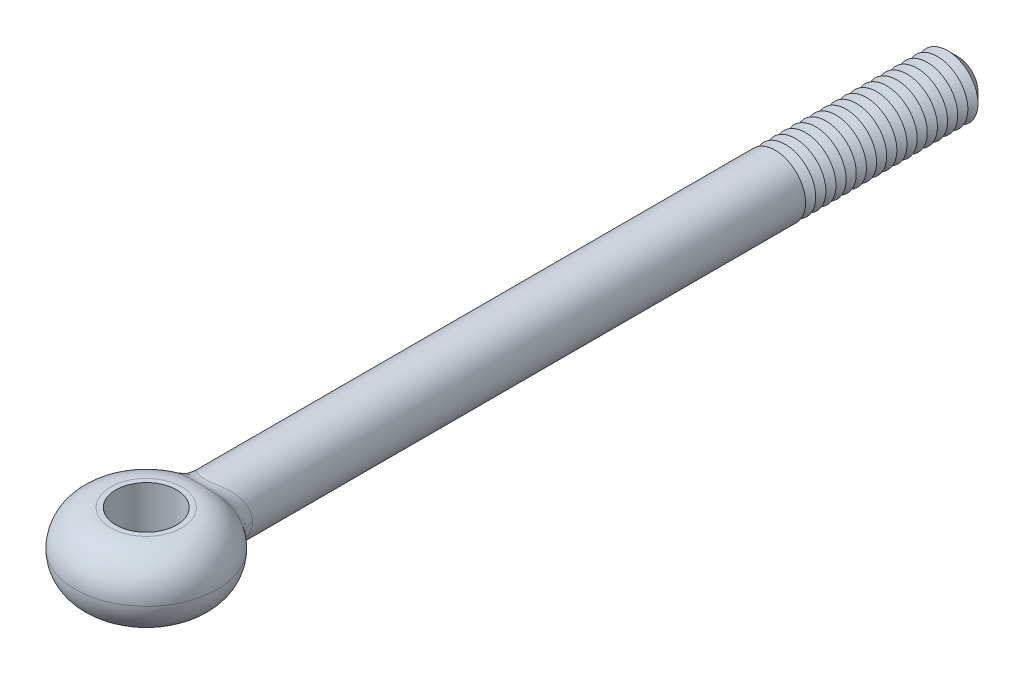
ISO-10303-21;
HEADER;
FILE_DESCRIPTION(('STEP AP214'),'2;1');
FILE_NAME('part.step','',(''),(''),'','','');
FILE_SCHEMA(('AUTOMOTIVE_DESIGN { 1 0 10303 214 1 1 1 1 }'));
ENDSEC;
DATA;
#1=APPLICATION_CONTEXT('core data for automotive mechanical design processes');
#2=APPLICATION_PROTOCOL_DEFINITION('international standard','automotive_design',2000,#1);
#3=PRODUCT_CONTEXT('',#1,'mechanical');
#4=PRODUCT('Part','Part','',(#3));
#5=PRODUCT_RELATED_PRODUCT_CATEGORY('part','',(#4));
#6=PRODUCT_DEFINITION_FORMATION('','',#4);
#7=PRODUCT_DEFINITION_CONTEXT('part definition',#1,'design');
#8=PRODUCT_DEFINITION('design','',#6,#7);
#9=PRODUCT_DEFINITION_SHAPE('','',#8);
#10=(LENGTH_UNIT() NAMED_UNIT(*) SI_UNIT(.MILLI.,.METRE.));
#11=(NAMED_UNIT(*) PLANE_ANGLE_UNIT() SI_UNIT($,.RADIAN.));
#12=(NAMED_UNIT(*) SI_UNIT($,.STERADIAN.) SOLID_ANGLE_UNIT());
#13=UNCERTAINTY_MEASURE_WITH_UNIT(LENGTH_MEASURE(1.E-05),#10,'distance_accuracy_value','');
#14=(GEOMETRIC_REPRESENTATION_CONTEXT(3) GLOBAL_UNCERTAINTY_ASSIGNED_CONTEXT((#13)) GLOBAL_UNIT_ASSIGNED_CONTEXT((#10,
#11,#12)) REPRESENTATION_CONTEXT('',''));
#15=CARTESIAN_POINT('',(0.,0.,0.));
#16=DIRECTION('',(0.,0.,1.));
#17=DIRECTION('',(1.,0.,0.));
#18=AXIS2_PLACEMENT_3D('',#15,#16,#17);
#19=CARTESIAN_POINT('',(0.,0.,-80.));
#20=DIRECTION('',(0.,0.,1.));
#21=DIRECTION('',(1.,0.,0.));
#22=AXIS2_PLACEMENT_3D('',#19,#20,#21);
#23=CYLINDRICAL_SURFACE('',#22,3.);
#24=CARTESIAN_POINT('',(0.,0.,-62.));
#25=DIRECTION('',(0.,0.,-1.));
#26=DIRECTION('',(-1.,0.,0.));
#27=AXIS2_PLACEMENT_3D('',#24,#25,#26);
#28=CIRCLE('',#27,3.);
#29=CARTESIAN_POINT('',(-3.,0.,-62.));
#30=VERTEX_POINT('',#29);
#31=EDGE_CURVE('E79',#30,#30,#28,.T.);
#32=ORIENTED_EDGE('',*,*,#31,.F.);
#33=EDGE_LOOP('',(#32));
#34=FACE_BOUND('',#33,.T.);
#35=CARTESIAN_POINT('',(3.20867656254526,-1.86688953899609,-5.60738897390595));
#36=CARTESIAN_POINT('',(2.56096665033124,-1.57853791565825,-6.18752111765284));
#37=CARTESIAN_POINT('',(2.42933329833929,-1.76021013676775,-7.07571927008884));
#38=CARTESIAN_POINT('',(3.2640375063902,-1.79983468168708,-5.62443905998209));
#39=CARTESIAN_POINT('',(2.59942976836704,-1.51546797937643,-6.20680511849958));
#40=CARTESIAN_POINT('',(2.47515209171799,-1.69698698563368,-7.10859962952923));
#41=CARTESIAN_POINT('',(3.31639317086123,-1.73064721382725,-5.64064739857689));
#42=CARTESIAN_POINT('',(2.6351235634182,-1.45163102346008,-6.22483857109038));
#43=CARTESIAN_POINT('',(2.51864422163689,-1.63175308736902,-7.13979554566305));
#44=CARTESIAN_POINT('',(3.41480339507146,-1.58839610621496,-5.67122752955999));
#45=CARTESIAN_POINT('',(2.70133077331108,-1.32242780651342,-6.2584928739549));
#46=CARTESIAN_POINT('',(2.60062893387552,-1.49763061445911,-7.19856096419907));
#47=CARTESIAN_POINT('',(3.46085609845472,-1.51533133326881,-5.68559878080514));
#48=CARTESIAN_POINT('',(2.73180651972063,-1.25708225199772,-6.27409557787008));
#49=CARTESIAN_POINT('',(2.63912004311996,-1.42874097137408,-7.22612939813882));
#50=CARTESIAN_POINT('',(3.546356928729,-1.3657196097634,-5.71234772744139));
#51=CARTESIAN_POINT('',(2.78768215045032,-1.12523153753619,-6.30284909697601));
#52=CARTESIAN_POINT('',(2.71074587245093,-1.28767848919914,-7.27737465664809));
#53=CARTESIAN_POINT('',(3.58580195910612,-1.28917104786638,-5.72472448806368));
#54=CARTESIAN_POINT('',(2.81304620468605,-1.05875480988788,-6.31598215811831));
#55=CARTESIAN_POINT('',(2.74387808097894,-1.21550413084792,-7.30104965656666));
#56=CARTESIAN_POINT('',(3.65776513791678,-1.13315402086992,-5.74734510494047));
#57=CARTESIAN_POINT('',(2.85880293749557,-0.925006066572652,-6.33977838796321));
#58=CARTESIAN_POINT('',(2.80443437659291,-1.06840236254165,-7.34427305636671));
#59=CARTESIAN_POINT('',(3.69028421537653,-1.05368594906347,-5.75758924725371));
#60=CARTESIAN_POINT('',(2.87916694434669,-0.857769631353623,-6.35042700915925));
#61=CARTESIAN_POINT('',(2.8318592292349,-0.993475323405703,-7.36382200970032));
#62=CARTESIAN_POINT('',(3.77515525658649,-0.816961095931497,-5.78435527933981));
#63=CARTESIAN_POINT('',(2.93190738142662,-0.659429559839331,-6.37810010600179));
#64=CARTESIAN_POINT('',(2.90352890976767,-0.770277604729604,-7.41485863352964));
#65=CARTESIAN_POINT('',(3.81771867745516,-0.656277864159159,-5.79782156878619));
#66=CARTESIAN_POINT('',(2.95751731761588,-0.527948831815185,-6.39167488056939));
#67=CARTESIAN_POINT('',(2.93960625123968,-0.618776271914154,-7.44047691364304));
#68=CARTESIAN_POINT('',(3.87457638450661,-0.330399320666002,-5.81581906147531));
#69=CARTESIAN_POINT('',(2.99160360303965,-0.264144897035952,-6.40978099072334));
#70=CARTESIAN_POINT('',(2.98783417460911,-0.311519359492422,-7.47469955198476));
#71=CARTESIAN_POINT('',(3.88889240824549,-0.165207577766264,-5.82035713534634));
#72=CARTESIAN_POINT('',(3.00000126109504,-0.132171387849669,-6.41427063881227));
#73=CARTESIAN_POINT('',(3.0000031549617,-0.155767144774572,-7.48331699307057));
#74=CARTESIAN_POINT('',(3.88888530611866,0.168184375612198,-5.82035471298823));
#75=CARTESIAN_POINT('',(2.99999871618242,0.134552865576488,-6.41426895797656));
#76=CARTESIAN_POINT('',(2.99999678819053,0.158573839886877,-7.48331251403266));
#77=CARTESIAN_POINT('',(3.87404149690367,0.336385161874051,-5.81564916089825));
#78=CARTESIAN_POINT('',(2.99129334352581,0.268928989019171,-6.40961447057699));
#79=CARTESIAN_POINT('',(2.98737884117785,0.317163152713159,-7.47437716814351));
#80=CARTESIAN_POINT('',(3.81515698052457,0.667880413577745,-5.79701135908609));
#81=CARTESIAN_POINT('',(2.9559743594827,0.537385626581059,-6.39085708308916));
#82=CARTESIAN_POINT('',(2.9374350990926,0.62971581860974,-7.4389355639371));
#83=CARTESIAN_POINT('',(3.77110419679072,0.831172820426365,-5.78307529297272));
#84=CARTESIAN_POINT('',(2.92945190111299,0.67109871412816,-6.37680244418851));
#85=CARTESIAN_POINT('',(2.90009908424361,0.783677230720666,-7.41242203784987));
#86=CARTESIAN_POINT('',(3.65533406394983,1.14793503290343,-5.74656955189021));
#87=CARTESIAN_POINT('',(2.85749109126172,0.936601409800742,-6.33906369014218));
#88=CARTESIAN_POINT('',(2.80235516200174,1.08233874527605,-7.34280559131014));
#89=CARTESIAN_POINT('',(3.58366301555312,1.30142077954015,-5.7240143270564));
#90=CARTESIAN_POINT('',(2.81227210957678,1.0680825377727,-6.31549258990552));
#91=CARTESIAN_POINT('',(2.74198587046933,1.22705387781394,-7.29973043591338));
#92=CARTESIAN_POINT('',(3.41475253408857,1.59497155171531,-5.67118021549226));
#93=CARTESIAN_POINT('',(2.70177181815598,1.32703977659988,-6.25865078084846));
#94=CARTESIAN_POINT('',(2.60051087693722,1.50383032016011,-7.19850118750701));
#95=CARTESIAN_POINT('',(3.31751497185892,1.73503755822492,-5.64090189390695));
#96=CARTESIAN_POINT('',(2.63674651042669,1.454297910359,-6.22550711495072));
#97=CARTESIAN_POINT('',(2.51940669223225,1.63589255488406,-7.14034819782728));
#98=CARTESIAN_POINT('',(3.09637392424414,2.00293825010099,-5.57280936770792));
#99=CARTESIAN_POINT('',(2.48348634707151,1.70556577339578,-6.14868274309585));
#100=CARTESIAN_POINT('',(2.33639294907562,1.88848463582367,-7.00903326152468));
#101=CARTESIAN_POINT('',(2.97172019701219,2.13024172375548,-5.53478597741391));
#102=CARTESIAN_POINT('',(2.3948646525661,1.82927288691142,-6.10483301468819));
#103=CARTESIAN_POINT('',(2.23390334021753,2.00851362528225,-6.93545250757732));
#104=CARTESIAN_POINT('',(2.69996830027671,2.3651018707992,-5.45362314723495));
#105=CARTESIAN_POINT('',(2.19516623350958,2.06511554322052,-6.0083348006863));
#106=CARTESIAN_POINT('',(2.01290711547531,2.22995319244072,-6.77759807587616));
#107=CARTESIAN_POINT('',(2.55285883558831,2.47264854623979,-5.41048113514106));
#108=CARTESIAN_POINT('',(2.08437280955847,2.17728215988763,-5.95580351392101));
#109=CARTESIAN_POINT('',(1.89439244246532,2.33135434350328,-6.69331902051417));
#110=CARTESIAN_POINT('',(2.30998722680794,2.62203371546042,-5.3420402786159));
#111=CARTESIAN_POINT('',(1.89619405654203,2.33829445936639,-5.87000214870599));
#112=CARTESIAN_POINT('',(1.70155283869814,2.47220321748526,-6.55887884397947));
#113=CARTESIAN_POINT('',(2.22150305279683,2.67143197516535,-5.3176024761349));
#114=CARTESIAN_POINT('',(1.82698546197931,2.39247654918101,-5.83902999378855));
#115=CARTESIAN_POINT('',(1.6318003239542,2.51877871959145,-6.51073776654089));
#116=CARTESIAN_POINT('',(2.03843806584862,2.76380875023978,-5.26856885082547));
#117=CARTESIAN_POINT('',(1.68220937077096,2.4954877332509,-5.77608718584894));
#118=CARTESIAN_POINT('',(1.48876141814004,2.60587682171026,-6.41385450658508));
#119=CARTESIAN_POINT('',(1.94385887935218,2.80678896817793,-5.24397307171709));
#120=CARTESIAN_POINT('',(1.60666598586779,2.54435586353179,-5.74411696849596));
#121=CARTESIAN_POINT('',(1.41547597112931,2.64640102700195,-6.36511248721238));
#122=CARTESIAN_POINT('',(1.74840195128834,2.88622799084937,-5.19533539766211));
#123=CARTESIAN_POINT('',(1.44916682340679,2.63609614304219,-5.68016772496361));
#124=CARTESIAN_POINT('',(1.26552728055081,2.72130067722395,-6.26843880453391));
#125=CARTESIAN_POINT('',(1.64751683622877,2.92267896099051,-5.17129419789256));
#126=CARTESIAN_POINT('',(1.36720978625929,2.67900755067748,-5.64817791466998));
#127=CARTESIAN_POINT('',(1.18886011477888,2.75566873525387,-6.22050817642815));
#128=CARTESIAN_POINT('',(1.43932773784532,2.9888232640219,-5.12481803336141));
#129=CARTESIAN_POINT('',(1.19698367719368,2.75798926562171,-5.58572642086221));
#130=CARTESIAN_POINT('',(1.03236587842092,2.81803336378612,-6.12758795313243));
#131=CARTESIAN_POINT('',(1.33202619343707,3.01851914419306,-5.10238246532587));
#132=CARTESIAN_POINT('',(1.10870348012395,2.79411419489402,-5.55524119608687));
#133=CARTESIAN_POINT('',(0.952540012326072,2.84603233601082,-6.08259725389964));
#134=CARTESIAN_POINT('',(1.14714488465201,3.0622946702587,-5.06741366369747));
#135=CARTESIAN_POINT('',(0.955864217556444,2.84805312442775,-5.50733016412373));
#136=CARTESIAN_POINT('',(0.816529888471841,2.88730640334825,-6.01230192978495));
#137=CARTESIAN_POINT('',(1.0713798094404,3.07829978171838,-5.05404848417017));
#138=CARTESIAN_POINT('',(0.893090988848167,2.86798092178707,-5.48891166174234));
#139=CARTESIAN_POINT('',(0.761192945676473,2.90239693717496,-5.98538526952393));
#140=CARTESIAN_POINT('',(0.916863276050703,3.10704015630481,-5.02923110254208));
#141=CARTESIAN_POINT('',(0.764832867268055,2.90402976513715,-5.45456574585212));
#142=CARTESIAN_POINT('',(0.649139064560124,2.92949500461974,-5.93533347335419));
#143=CARTESIAN_POINT('',(0.838111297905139,3.1197748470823,-5.01777923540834));
#144=CARTESIAN_POINT('',(0.699327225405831,2.92016650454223,-5.43862583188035));
#145=CARTESIAN_POINT('',(0.592421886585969,2.94150199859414,-5.91219899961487));
#146=CARTESIAN_POINT('',(0.678229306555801,3.14177269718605,-4.99746218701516));
#147=CARTESIAN_POINT('',(0.566195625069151,2.94820006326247,-5.41026040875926));
#148=CARTESIAN_POINT('',(0.477997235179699,2.96224282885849,-5.87111000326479));
#149=CARTESIAN_POINT('',(0.597112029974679,3.15105169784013,-4.98858524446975));
#150=CARTESIAN_POINT('',(0.49855284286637,2.96013078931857,-5.39780561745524));
#151=CARTESIAN_POINT('',(0.42029558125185,2.970991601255,-5.85313193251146));
#152=CARTESIAN_POINT('',(0.432732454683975,3.16605777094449,-4.97397511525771));
#153=CARTESIAN_POINT('',(0.361419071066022,2.97949280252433,-5.37727320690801));
#154=CARTESIAN_POINT('',(0.303924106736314,2.98514018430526,-5.82352161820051));
#155=CARTESIAN_POINT('',(0.349471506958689,3.17178702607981,-4.96823999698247));
#156=CARTESIAN_POINT('',(0.291891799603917,2.98693839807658,-5.36918117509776));
#157=CARTESIAN_POINT('',(0.245254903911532,2.9905420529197,-5.81188547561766));
#158=CARTESIAN_POINT('',(0.180705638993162,3.17961288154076,-4.96035475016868));
#159=CARTESIAN_POINT('',(0.150966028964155,2.99711750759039,-5.35805376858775));
#160=CARTESIAN_POINT('',(0.126651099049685,2.99792071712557,-5.79588271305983));
#161=CARTESIAN_POINT('',(0.0951859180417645,3.18166687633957,-4.95824667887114));
#162=CARTESIAN_POINT('',(0.0795084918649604,2.99980259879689,-5.35507030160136));
#163=CARTESIAN_POINT('',(0.0667097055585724,2.99985734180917,-5.79160137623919));
#164=CARTESIAN_POINT('',(-0.0758990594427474,3.18195333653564,-4.95795434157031));
#165=CARTESIAN_POINT('',(-0.0633965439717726,3.00017632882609,-5.35465714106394));
#166=CARTESIAN_POINT('',(-0.0531929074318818,3.00012743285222,-5.79100779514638));
#167=CARTESIAN_POINT('',(-0.161464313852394,3.18018596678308,-4.95976990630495));
#168=CARTESIAN_POINT('',(-0.134893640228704,2.99786544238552,-5.35722692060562));
#169=CARTESIAN_POINT('',(-0.113154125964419,2.99846105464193,-5.79469520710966));
#170=CARTESIAN_POINT('',(-0.331649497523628,3.17286894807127,-4.96715548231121));
#171=CARTESIAN_POINT('',(-0.277011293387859,2.98834413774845,-5.36765144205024));
#172=CARTESIAN_POINT('',(-0.232710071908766,2.99156215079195,-5.80968494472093));
#173=CARTESIAN_POINT('',(-0.416265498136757,3.16730714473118,-4.97273755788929));
#174=CARTESIAN_POINT('',(-0.347675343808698,2.98111153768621,-5.37553016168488));
#175=CARTESIAN_POINT('',(-0.292302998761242,2.98631816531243,-5.82101173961));
#176=CARTESIAN_POINT('',(-0.583319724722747,3.15252271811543,-4.98717042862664));
#177=CARTESIAN_POINT('',(-0.487052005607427,2.96202363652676,-5.3958201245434));
#178=CARTESIAN_POINT('',(-0.410500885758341,2.97237856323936,-5.85026594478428));
#179=CARTESIAN_POINT('',(-0.665756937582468,3.1432984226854,-4.99602271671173));
#180=CARTESIAN_POINT('',(-0.555803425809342,2.9501544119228,-5.40824549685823));
#181=CARTESIAN_POINT('',(-0.469105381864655,2.96368137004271,-5.86819636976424));
#182=CARTESIAN_POINT('',(-0.852542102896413,3.11800936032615,-5.01944463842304));
#183=CARTESIAN_POINT('',(-0.711397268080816,2.91789597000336,-5.44096622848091));
#184=CARTESIAN_POINT('',(-0.602710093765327,2.9398373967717,-5.91556991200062));
#185=CARTESIAN_POINT('',(-0.955914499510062,3.10071678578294,-5.03493446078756));
#186=CARTESIAN_POINT('',(-0.797372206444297,2.89599454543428,-5.46252153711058));
#187=CARTESIAN_POINT('',(-0.677266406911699,2.92353296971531,-5.9468562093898));
#188=CARTESIAN_POINT('',(-1.15747034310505,3.06050331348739,-5.06896237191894));
#189=CARTESIAN_POINT('',(-0.964489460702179,2.84579648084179,-5.50948574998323));
#190=CARTESIAN_POINT('',(-0.82399035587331,2.88561741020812,-6.01542593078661));
#191=CARTESIAN_POINT('',(-1.25565167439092,3.03758014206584,-5.08750169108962));
#192=CARTESIAN_POINT('',(-1.0456709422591,2.81745945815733,-5.53492466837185));
#193=CARTESIAN_POINT('',(-0.896157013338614,2.8640041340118,-6.05271177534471));
#194=CARTESIAN_POINT('',(-1.44701488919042,2.98629407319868,-5.12649976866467));
#195=CARTESIAN_POINT('',(-1.20319716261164,2.75504714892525,-5.58794679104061));
#196=CARTESIAN_POINT('',(-1.03815002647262,2.8156486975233,-6.130943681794));
#197=CARTESIAN_POINT('',(-1.54018815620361,2.95792216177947,-5.1469616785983));
#198=CARTESIAN_POINT('',(-1.27955391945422,2.72092467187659,-5.61555495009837));
#199=CARTESIAN_POINT('',(-1.10797227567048,2.78889803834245,-6.17189574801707));
#200=CARTESIAN_POINT('',(-1.72151711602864,2.89592293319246,-5.18889273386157));
#201=CARTESIAN_POINT('',(-1.42727129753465,2.64757180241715,-5.67156834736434));
#202=CARTESIAN_POINT('',(-1.24508737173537,2.73044162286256,-6.25559228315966));
#203=CARTESIAN_POINT('',(-1.80967353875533,2.86229638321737,-5.21036173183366));
#204=CARTESIAN_POINT('',(-1.49863783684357,2.60830676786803,-5.69998707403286));
#205=CARTESIAN_POINT('',(-1.31238058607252,2.69873658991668,-6.29833648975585));
#206=CARTESIAN_POINT('',(-1.98571143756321,2.78796010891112,-5.25480393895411));
#207=CARTESIAN_POINT('',(-1.64009897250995,2.52294667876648,-5.75819924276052));
#208=CARTESIAN_POINT('',(-1.44787080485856,2.62864810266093,-6.38658240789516));
#209=CARTESIAN_POINT('',(-2.07332759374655,2.746968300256,-5.27779631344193));
#210=CARTESIAN_POINT('',(-1.70989675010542,2.47657447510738,-5.78798453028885));
#211=CARTESIAN_POINT('',(-1.51592466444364,2.58999868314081,-6.43210962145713));
#212=CARTESIAN_POINT('',(-2.2432391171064,2.65939261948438,-5.32358826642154));
#213=CARTESIAN_POINT('',(-1.84397839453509,2.37927832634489,-5.846613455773));
#214=CARTESIAN_POINT('',(-1.64892099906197,2.50742732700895,-6.52253244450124));
#215=CARTESIAN_POINT('',(-2.32553297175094,2.61280716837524,-5.34638778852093));
#216=CARTESIAN_POINT('',(-1.90824127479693,2.32832315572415,-5.87545589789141));
#217=CARTESIAN_POINT('',(-1.71386258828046,2.46350390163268,-6.56742787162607));
#218=CARTESIAN_POINT('',(-2.56416331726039,2.46496130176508,-5.41374113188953));
#219=CARTESIAN_POINT('',(-2.09300733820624,2.16915106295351,-5.9598294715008));
#220=CARTESIAN_POINT('',(-1.90344199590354,2.32410637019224,-6.69970299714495));
#221=CARTESIAN_POINT('',(-2.71256686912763,2.35547619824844,-5.45733353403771));
#222=CARTESIAN_POINT('',(-2.20461350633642,2.05516387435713,-6.01283232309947));
#223=CARTESIAN_POINT('',(-2.02308115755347,2.22087755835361,-6.78483780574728));
#224=CARTESIAN_POINT('',(-3.00301596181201,2.10163957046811,-5.54419617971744));
#225=CARTESIAN_POINT('',(-2.41778154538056,1.80070495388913,-6.11598887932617));
#226=CARTESIAN_POINT('',(-2.25944200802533,1.98154588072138,-6.95372540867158));
#227=CARTESIAN_POINT('',(-3.14209904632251,1.95466818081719,-5.58678396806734));
#228=CARTESIAN_POINT('',(-2.51591581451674,1.65883259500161,-6.16477103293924));
#229=CARTESIAN_POINT('',(-2.37404369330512,1.84297285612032,-7.03605392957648));
#230=CARTESIAN_POINT('',(-3.38785298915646,1.63858571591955,-5.66272580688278));
#231=CARTESIAN_POINT('',(-2.68453053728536,1.36565972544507,-6.24972770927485));
#232=CARTESIAN_POINT('',(-2.57792192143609,1.54495224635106,-7.18232146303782));
#233=CARTESIAN_POINT('',(-3.49450592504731,1.46946247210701,-5.69607475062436));
#234=CARTESIAN_POINT('',(-2.75453740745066,1.21455209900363,-6.28567815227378));
#235=CARTESIAN_POINT('',(-2.66718445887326,1.38549318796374,-7.24625030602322));
#236=CARTESIAN_POINT('',(-3.66380219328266,1.1299583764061,-5.74921606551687));
#237=CARTESIAN_POINT('',(-2.86316402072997,0.920881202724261,-6.3419757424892));
#238=CARTESIAN_POINT('',(-2.8094401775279,1.06538932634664,-7.34787971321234));
#239=CARTESIAN_POINT('',(-3.72945621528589,0.960953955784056,-5.76993212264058));
#240=CARTESIAN_POINT('',(-2.90370657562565,0.778947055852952,-6.36326874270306));
#241=CARTESIAN_POINT('',(-2.86490429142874,0.906042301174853,-7.38737179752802));
#242=CARTESIAN_POINT('',(-3.82803878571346,0.614436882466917,-5.80107948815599));
#243=CARTESIAN_POINT('',(-2.96393533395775,0.49336864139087,-6.39505004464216));
#244=CARTESIAN_POINT('',(-2.94832898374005,0.579326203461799,-7.44668580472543));
#245=CARTESIAN_POINT('',(-3.86106115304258,0.436950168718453,-5.81154028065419));
#246=CARTESIAN_POINT('',(-2.98349655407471,0.350141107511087,-6.40547274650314));
#247=CARTESIAN_POINT('',(-2.97636840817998,0.4119815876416,-7.46656411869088));
#248=CARTESIAN_POINT('',(-3.88111578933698,0.215363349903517,-5.81789329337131));
#249=CARTESIAN_POINT('',(-2.99539251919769,0.172394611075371,-6.41181290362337));
#250=CARTESIAN_POINT('',(-2.99339822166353,0.203056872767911,-7.47863586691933));
#251=CARTESIAN_POINT('',(-3.88402884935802,0.172339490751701,-5.81881611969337));
#252=CARTESIAN_POINT('',(-2.99712106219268,0.137923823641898,-6.41273432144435));
#253=CARTESIAN_POINT('',(-2.99587203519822,0.16249151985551,-7.48038932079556));
#254=CARTESIAN_POINT('',(-3.88791595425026,0.0862156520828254,-5.82004764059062));
#255=CARTESIAN_POINT('',(-2.99942439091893,0.0689697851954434,-6.41396268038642));
#256=CARTESIAN_POINT('',(-2.99917350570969,0.0812890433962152,-7.48272910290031));
#257=CARTESIAN_POINT('',(-3.88889040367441,0.0431156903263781,-5.82035646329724));
#258=CARTESIAN_POINT('',(-2.99999898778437,0.0344929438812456,-6.41426952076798));
#259=CARTESIAN_POINT('',(-3.00000150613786,0.0406519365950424,-7.48331567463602));
#260=CARTESIAN_POINT('',(-3.88888299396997,-0.167788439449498,-5.82035387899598));
#261=CARTESIAN_POINT('',(-3.00000393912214,-0.134232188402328,-6.41427091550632));
#262=CARTESIAN_POINT('',(-2.9999941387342,-0.15820052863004,-7.48331126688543));
#263=CARTESIAN_POINT('',(-3.87409666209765,-0.335815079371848,-5.81566687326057));
#264=CARTESIAN_POINT('',(-2.99132704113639,-0.268467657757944,-6.40963250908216));
#265=CARTESIAN_POINT('',(-2.98742586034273,-0.316625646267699,-7.47441080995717));
#266=CARTESIAN_POINT('',(-3.81528095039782,-0.667441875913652,-5.79705034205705));
#267=CARTESIAN_POINT('',(-2.95604795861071,-0.537030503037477,-6.39089602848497));
#268=CARTESIAN_POINT('',(-2.93754001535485,-0.629302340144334,-7.43900973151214));
#269=CARTESIAN_POINT('',(-3.77115080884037,-0.831024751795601,-5.78308897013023));
#270=CARTESIAN_POINT('',(-2.92948278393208,-0.670988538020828,-6.3768176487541));
#271=CARTESIAN_POINT('',(-2.90013717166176,-0.783537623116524,-7.41244846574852));
#272=CARTESIAN_POINT('',(-3.68420709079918,-1.06894491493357,-5.75567457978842));
#273=CARTESIAN_POINT('',(-2.87536500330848,-0.870652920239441,-6.34843788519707));
#274=CARTESIAN_POINT('',(-2.82673309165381,-1.00786234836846,-7.36016870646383));
#275=CARTESIAN_POINT('',(-3.65178721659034,-1.14697548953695,-5.74546383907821));
#276=CARTESIAN_POINT('',(-2.85503050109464,-0.936773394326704,-6.33781082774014));
#277=CARTESIAN_POINT('',(-2.79939811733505,-1.08143403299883,-7.34068082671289));
#278=CARTESIAN_POINT('',(-3.58025604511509,-1.30018288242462,-5.72298379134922));
#279=CARTESIAN_POINT('',(-2.80948516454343,-1.06829583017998,-6.31413687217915));
#280=CARTESIAN_POINT('',(-2.73921822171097,-1.22588671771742,-7.29772059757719));
#281=CARTESIAN_POINT('',(-3.54114381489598,-1.37535930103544,-5.71071419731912));
#282=CARTESIAN_POINT('',(-2.78430184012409,-1.13366420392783,-6.30110391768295));
#283=CARTESIAN_POINT('',(-2.70637253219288,-1.29676734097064,-7.27424769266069));
#284=CARTESIAN_POINT('',(-3.45663845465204,-1.52213332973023,-5.68428226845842));
#285=CARTESIAN_POINT('',(-2.72901827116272,-1.26315433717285,-6.27266712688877));
#286=CARTESIAN_POINT('',(-2.63559380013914,-1.43515428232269,-7.22360441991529));
#287=CARTESIAN_POINT('',(-3.41126467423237,-1.59374107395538,-5.67012576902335));
#288=CARTESIAN_POINT('',(-2.69896514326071,-1.32725151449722,-6.25728646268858));
#289=CARTESIAN_POINT('',(-2.59767644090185,-1.50267015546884,-7.19644544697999));
#290=CARTESIAN_POINT('',(-3.31444986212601,-1.73321286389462,-5.64004567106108));
#291=CARTESIAN_POINT('',(-2.63379544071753,-1.4540048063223,-6.22416747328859));
#292=CARTESIAN_POINT('',(-2.51702985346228,-1.63417212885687,-7.13863740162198));
#293=CARTESIAN_POINT('',(-3.26301063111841,-1.80107801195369,-5.6241225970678));
#294=CARTESIAN_POINT('',(-2.59871455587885,-1.51664149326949,-6.20644633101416));
#295=CARTESIAN_POINT('',(-2.47430205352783,-1.69815926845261,-7.10798936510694));
#296=CARTESIAN_POINT('',(-3.20867656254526,-1.86688953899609,-5.60738897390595));
#297=CARTESIAN_POINT('',(-2.56096665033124,-1.57853791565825,-6.18752111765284));
#298=CARTESIAN_POINT('',(-2.42933329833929,-1.76021013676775,-7.07571927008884));
#299=(BOUNDED_SURFACE() B_SPLINE_SURFACE(3,2,((#35,#36,#37),(#38,#39,#40),(#41,#42,#43),(#44,
#45,#46),(#47,#48,#49),(#50,#51,#52),(#53,#54,#55),(#56,#57,#58),(#59,#60,#61),(#62,#63,#64),
(#65,#66,#67),(#68,#69,#70),(#71,#72,#73),(#74,#75,#76),(#77,#78,#79),(#80,#81,#82),(#83,#84,
#85),(#86,#87,#88),(#89,#90,#91),(#92,#93,#94),(#95,#96,#97),(#98,#99,#100),(#101,#102,#103),
(#104,#105,#106),(#107,#108,#109),(#110,#111,#112),(#113,#114,#115),(#116,#117,#118),(#119,#120,
#121),(#122,#123,#124),(#125,#126,#127),(#128,#129,#130),(#131,#132,#133),(#134,#135,#136),
(#137,#138,#139),(#140,#141,#142),(#143,#144,#145),(#146,#147,#148),(#149,#150,#151),(#152,#153,
#154),(#155,#156,#157),(#158,#159,#160),(#161,#162,#163),(#164,#165,#166),(#167,#168,#169),
(#170,#171,#172),(#173,#174,#175),(#176,#177,#178),(#179,#180,#181),(#182,#183,#184),(#185,#186,
#187),(#188,#189,#190),(#191,#192,#193),(#194,#195,#196),(#197,#198,#199),(#200,#201,#202),
(#203,#204,#205),(#206,#207,#208),(#209,#210,#211),(#212,#213,#214),(#215,#216,#217),(#218,#219,
#220),(#221,#222,#223),(#224,#225,#226),(#227,#228,#229),(#230,#231,#232),(#233,#234,#235),
(#236,#237,#238),(#239,#240,#241),(#242,#243,#244),(#245,#246,#247),(#248,#249,#250),(#251,#252,
#253),(#254,#255,#256),(#257,#258,#259),(#260,#261,#262),(#263,#264,#265),(#266,#267,#268),
(#269,#270,#271),(#272,#273,#274),(#275,#276,#277),(#278,#279,#280),(#281,#282,#283),(#284,#285,
#286),(#287,#288,#289),(#290,#291,#292),(#293,#294,#295),(#296,#297,#298)),.UNSPECIFIED.,.F.,
.F.,.F.) B_SPLINE_SURFACE_WITH_KNOTS((4,2,2,2,2,2,2,2,2,2,2,2,2,2,2,2,2,2,2,2,2,2,2,2,2,2,2,2,2,
2,2,2,2,2,2,2,2,2,2,2,2,2,2,4),(3,3),(0.,0.402578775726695,0.805275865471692,1.20816114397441,
1.61099234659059,2.38951834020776,3.16744499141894,3.95938873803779,4.75166012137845,
5.54260903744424,6.33350009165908,7.14956449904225,7.96604074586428,8.40919064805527,
8.85222278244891,9.29578301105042,9.7391756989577,10.0369232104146,10.334722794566,
10.6311399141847,10.9273745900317,11.2270216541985,11.5266557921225,11.8272542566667,
12.1279901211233,12.5203401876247,12.9128489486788,13.3060127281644,13.6991191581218,
14.1131872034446,14.5273724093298,15.3542822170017,16.2816457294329,17.2095208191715,
18.0570670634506,18.9021693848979,19.1054047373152,19.3085976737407,20.0993405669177,
20.8928128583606,21.2891887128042,21.6856198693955,22.0808523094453,22.4759677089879),(0.,1.),
.UNSPECIFIED.) GEOMETRIC_REPRESENTATION_ITEM() RATIONAL_B_SPLINE_SURFACE(((1.,0.909163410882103,
1.),(1.,0.907082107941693,1.),(1.,0.905079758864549,1.),(1.,0.901265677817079,1.),(1.,
0.899454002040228,1.),(1.,0.896054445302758,1.),(1.,0.89446666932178,1.),(1.,0.8915452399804,
1.),(1.,0.890211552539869,1.),(1.,0.8867092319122,1.),(1.,0.884921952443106,1.),(1.,
0.882526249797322,1.),(1.,0.881916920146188,1.),(1.,0.881917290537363,1.),(1.,0.882549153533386,
1.),(1.,0.885029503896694,1.),(1.,0.88687849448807,1.),(1.,0.891651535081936,1.),(1.,
0.894573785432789,1.),(1.,0.901284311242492,1.),(1.,0.905072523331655,1.),(1.,0.913384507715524,
1.),(1.,0.917927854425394,1.),(1.,0.927337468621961,1.),(1.,0.932203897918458,1.),(1.,
0.93966862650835,1.),(1.,0.942286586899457,1.),(1.,0.947441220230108,1.),(1.,0.949977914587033,
1.),(1.,0.954897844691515,1.),(1.,0.957280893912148,1.),(1.,0.961800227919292,1.),(1.,
0.963936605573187,1.),(1.,0.967208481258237,1.),(1.,0.968442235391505,1.),(1.,0.970708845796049,
1.),(1.,0.97174166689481,1.),(1.,0.973558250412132,1.),(1.,0.974343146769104,1.),(1.,
0.975627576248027,1.),(1.,0.976127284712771,1.),(1.,0.976812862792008,1.),(1.,0.976995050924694,
1.),(1.,0.977020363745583,1.),(1.,0.976863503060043,1.),(1.,0.976221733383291,1.),(1.,
0.975735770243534,1.),(1.,0.974468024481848,1.),(1.,0.973686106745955,1.),(1.,0.971593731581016,
1.),(1.,0.970194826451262,1.),(1.,0.967067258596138,1.),(1.,0.965338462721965,1.),(1.,
0.961634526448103,1.),(1.,0.959658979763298,1.),(1.,0.955535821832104,1.),(1.,0.95338823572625,
1.),(1.,0.948862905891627,1.),(1.,0.946478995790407,1.),(1.,0.941646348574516,1.),(1.,
0.939197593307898,1.),(1.,0.931841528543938,1.),(1.,0.926915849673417,1.),(1.,0.916826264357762,
1.),(1.,0.911706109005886,1.),(1.,0.902364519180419,1.),(1.,0.898143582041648,1.),(1.,
0.891316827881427,1.),(1.,0.888602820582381,1.),(1.,0.884494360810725,1.),(1.,0.883096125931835,
1.),(1.,0.882246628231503,1.),(1.,0.882123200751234,1.),(1.,0.881958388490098,1.),(1.,
0.881916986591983,1.),(1.,0.881917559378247,1.),(1.,0.88254679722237,1.),(1.,0.885024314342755,
1.),(1.,0.886876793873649,1.),(1.,0.890461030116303,1.),(1.,0.89178924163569,1.),(1.,
0.894690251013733,1.),(1.,0.896263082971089,1.),(1.,0.899620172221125,1.),(1.,0.90140377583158,
1.),(1.,0.90515408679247,1.),(1.,0.907120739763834,1.),(1.,0.909163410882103,1.))) REPRESENTATION_ITEM('') SURFACE());
#300=CARTESIAN_POINT('',(-2.42933329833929,-1.76021013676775,-7.07571927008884));
#301=CARTESIAN_POINT('',(-2.47430205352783,-1.69815926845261,-7.10798936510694));
#302=CARTESIAN_POINT('',(-2.51702985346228,-1.63417212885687,-7.13863740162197));
#303=CARTESIAN_POINT('',(-2.59767644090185,-1.50267015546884,-7.19644544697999));
#304=CARTESIAN_POINT('',(-2.63559380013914,-1.43515428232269,-7.22360441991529));
#305=CARTESIAN_POINT('',(-2.70637253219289,-1.29676734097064,-7.27424769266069));
#306=CARTESIAN_POINT('',(-2.73921822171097,-1.22588671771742,-7.29772059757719));
#307=CARTESIAN_POINT('',(-2.79939811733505,-1.08143403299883,-7.34068082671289));
#308=CARTESIAN_POINT('',(-2.82673309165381,-1.00786234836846,-7.36016870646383));
#309=CARTESIAN_POINT('',(-2.90013717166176,-0.783537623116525,-7.41244846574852));
#310=CARTESIAN_POINT('',(-2.93754001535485,-0.629302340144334,-7.43900973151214));
#311=CARTESIAN_POINT('',(-2.98742586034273,-0.316625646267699,-7.47441080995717));
#312=CARTESIAN_POINT('',(-2.9999941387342,-0.158200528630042,-7.48331126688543));
#313=CARTESIAN_POINT('',(-3.00000150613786,0.0406519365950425,-7.48331567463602));
#314=CARTESIAN_POINT('',(-2.99917350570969,0.0812890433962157,-7.48272910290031));
#315=CARTESIAN_POINT('',(-2.99587203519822,0.16249151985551,-7.48038932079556));
#316=CARTESIAN_POINT('',(-2.99339822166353,0.203056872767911,-7.47863586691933));
#317=CARTESIAN_POINT('',(-2.97636840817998,0.411981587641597,-7.46656411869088));
#318=CARTESIAN_POINT('',(-2.94832898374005,0.579326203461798,-7.44668580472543));
#319=CARTESIAN_POINT('',(-2.86490429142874,0.906042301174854,-7.38737179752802));
#320=CARTESIAN_POINT('',(-2.8094401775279,1.06538932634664,-7.34787971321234));
#321=CARTESIAN_POINT('',(-2.66718445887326,1.38549318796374,-7.24625030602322));
#322=CARTESIAN_POINT('',(-2.57792192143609,1.54495224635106,-7.18232146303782));
#323=CARTESIAN_POINT('',(-2.37404369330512,1.84297285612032,-7.03605392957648));
#324=CARTESIAN_POINT('',(-2.25944200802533,1.98154588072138,-6.95372540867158));
#325=CARTESIAN_POINT('',(-2.02308115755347,2.22087755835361,-6.78483780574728));
#326=CARTESIAN_POINT('',(-1.90344199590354,2.32410637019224,-6.69970299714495));
#327=CARTESIAN_POINT('',(-1.71386258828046,2.46350390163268,-6.56742787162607));
#328=CARTESIAN_POINT('',(-1.64892099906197,2.50742732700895,-6.52253244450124));
#329=CARTESIAN_POINT('',(-1.51592466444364,2.58999868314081,-6.43210962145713));
#330=CARTESIAN_POINT('',(-1.44787080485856,2.62864810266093,-6.38658240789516));
#331=CARTESIAN_POINT('',(-1.31238058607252,2.69873658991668,-6.29833648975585));
#332=CARTESIAN_POINT('',(-1.24508737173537,2.73044162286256,-6.25559228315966));
#333=CARTESIAN_POINT('',(-1.10797227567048,2.78889803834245,-6.17189574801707));
#334=CARTESIAN_POINT('',(-1.03815002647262,2.8156486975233,-6.130943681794));
#335=CARTESIAN_POINT('',(-0.896157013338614,2.8640041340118,-6.05271177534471));
#336=CARTESIAN_POINT('',(-0.82399035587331,2.88561741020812,-6.01542593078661));
#337=CARTESIAN_POINT('',(-0.677266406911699,2.92353296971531,-5.9468562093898));
#338=CARTESIAN_POINT('',(-0.602710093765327,2.9398373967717,-5.91556991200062));
#339=CARTESIAN_POINT('',(-0.469105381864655,2.96368137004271,-5.86819636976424));
#340=CARTESIAN_POINT('',(-0.410500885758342,2.97237856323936,-5.85026594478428));
#341=CARTESIAN_POINT('',(-0.292302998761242,2.98631816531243,-5.82101173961));
#342=CARTESIAN_POINT('',(-0.232710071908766,2.99156215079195,-5.80968494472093));
#343=CARTESIAN_POINT('',(-0.113154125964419,2.99846105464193,-5.79469520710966));
#344=CARTESIAN_POINT('',(-0.0531929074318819,3.00012743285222,-5.79100779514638));
#345=CARTESIAN_POINT('',(0.0667097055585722,2.99985734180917,-5.79160137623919));
#346=CARTESIAN_POINT('',(0.126651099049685,2.99792071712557,-5.79588271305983));
#347=CARTESIAN_POINT('',(0.245254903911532,2.9905420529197,-5.81188547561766));
#348=CARTESIAN_POINT('',(0.303924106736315,2.98514018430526,-5.82352161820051));
#349=CARTESIAN_POINT('',(0.42029558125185,2.970991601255,-5.85313193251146));
#350=CARTESIAN_POINT('',(0.477997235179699,2.96224282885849,-5.8711100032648));
#351=CARTESIAN_POINT('',(0.592421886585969,2.94150199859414,-5.91219899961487));
#352=CARTESIAN_POINT('',(0.649139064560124,2.92949500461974,-5.93533347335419));
#353=CARTESIAN_POINT('',(0.761192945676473,2.90239693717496,-5.98538526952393));
#354=CARTESIAN_POINT('',(0.816529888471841,2.88730640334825,-6.01230192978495));
#355=CARTESIAN_POINT('',(0.952540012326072,2.84603233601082,-6.08259725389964));
#356=CARTESIAN_POINT('',(1.03236587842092,2.81803336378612,-6.12758795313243));
#357=CARTESIAN_POINT('',(1.18886011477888,2.75566873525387,-6.22050817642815));
#358=CARTESIAN_POINT('',(1.26552728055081,2.72130067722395,-6.26843880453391));
#359=CARTESIAN_POINT('',(1.41547597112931,2.64640102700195,-6.36511248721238));
#360=CARTESIAN_POINT('',(1.48876141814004,2.60587682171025,-6.41385450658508));
#361=CARTESIAN_POINT('',(1.6318003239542,2.51877871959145,-6.51073776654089));
#362=CARTESIAN_POINT('',(1.70155283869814,2.47220321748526,-6.55887884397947));
#363=CARTESIAN_POINT('',(1.89439244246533,2.33135434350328,-6.69331902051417));
#364=CARTESIAN_POINT('',(2.01290711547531,2.22995319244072,-6.77759807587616));
#365=CARTESIAN_POINT('',(2.23390334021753,2.00851362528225,-6.93545250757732));
#366=CARTESIAN_POINT('',(2.33639294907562,1.88848463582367,-7.00903326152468));
#367=CARTESIAN_POINT('',(2.51940669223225,1.63589255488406,-7.14034819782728));
#368=CARTESIAN_POINT('',(2.60051087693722,1.50383032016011,-7.19850118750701));
#369=CARTESIAN_POINT('',(2.74198587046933,1.22705387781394,-7.29973043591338));
#370=CARTESIAN_POINT('',(2.80235516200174,1.08233874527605,-7.34280559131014));
#371=CARTESIAN_POINT('',(2.90009908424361,0.783677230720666,-7.41242203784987));
#372=CARTESIAN_POINT('',(2.9374350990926,0.62971581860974,-7.4389355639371));
#373=CARTESIAN_POINT('',(2.98737884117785,0.317163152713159,-7.47437716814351));
#374=CARTESIAN_POINT('',(2.99999678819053,0.158573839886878,-7.48331251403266));
#375=CARTESIAN_POINT('',(3.0000031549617,-0.155767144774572,-7.48331699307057));
#376=CARTESIAN_POINT('',(2.98783417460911,-0.311519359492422,-7.47469955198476));
#377=CARTESIAN_POINT('',(2.93960625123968,-0.618776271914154,-7.44047691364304));
#378=CARTESIAN_POINT('',(2.90352890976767,-0.770277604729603,-7.41485863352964));
#379=CARTESIAN_POINT('',(2.8318592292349,-0.993475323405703,-7.36382200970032));
#380=CARTESIAN_POINT('',(2.80443437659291,-1.06840236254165,-7.34427305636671));
#381=CARTESIAN_POINT('',(2.74387808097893,-1.21550413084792,-7.30104965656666));
#382=CARTESIAN_POINT('',(2.71074587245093,-1.28767848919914,-7.27737465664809));
#383=CARTESIAN_POINT('',(2.63912004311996,-1.42874097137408,-7.22612939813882));
#384=CARTESIAN_POINT('',(2.60062893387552,-1.49763061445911,-7.19856096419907));
#385=CARTESIAN_POINT('',(2.51864422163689,-1.63175308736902,-7.13979554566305));
#386=CARTESIAN_POINT('',(2.47515209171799,-1.69698698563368,-7.10859962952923));
#387=CARTESIAN_POINT('',(2.42933329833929,-1.76021013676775,-7.07571927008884));
#388=B_SPLINE_CURVE_WITH_KNOTS('',3,(#300,#301,#302,#303,#304,#305,#306,#307,#308,#309,#310,
#311,#312,#313,#314,#315,#316,#317,#318,#319,#320,#321,#322,#323,#324,#325,#326,#327,#328,#329,
#330,#331,#332,#333,#334,#335,#336,#337,#338,#339,#340,#341,#342,#343,#344,#345,#346,#347,#348,
#349,#350,#351,#352,#353,#354,#355,#356,#357,#358,#359,#360,#361,#362,#363,#364,#365,#366,#367,
#368,#369,#370,#371,#372,#373,#374,#375,#376,#377,#378,#379,#380,#381,#382,#383,#384,#385,#386,
#387),.UNSPECIFIED.,.F.,.F.,(4,2,2,2,2,2,2,2,2,2,2,2,2,2,2,2,2,2,2,2,2,2,2,2,2,2,2,2,2,2,2,2,2,
2,2,2,2,2,2,2,2,2,2,4),(0.,0.395115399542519,0.790347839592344,1.18677899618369,
1.58315485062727,2.37662714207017,3.16737003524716,3.3705629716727,3.57379832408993,
4.41890064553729,5.26644688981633,6.19432197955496,7.12168549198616,7.94859529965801,
8.36278050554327,8.77684855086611,9.16995498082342,9.56311876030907,9.9556275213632,
10.3479775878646,10.6487134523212,10.9493119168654,11.2489460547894,11.5485931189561,
11.8448277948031,12.1412449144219,12.4390444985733,12.7367920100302,13.1801846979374,
13.623744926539,14.0667770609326,14.5099269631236,15.3264032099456,16.1424676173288,
16.9333586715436,17.7243075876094,18.5165789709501,19.3085227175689,20.0864493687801,
20.8649753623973,21.2678065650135,21.6706918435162,22.0733889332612,22.4759677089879),.UNSPECIFIED.);
#389=CARTESIAN_POINT('',(-3.,0.,-7.48331477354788));
#390=VERTEX_POINT('',#389);
#391=CARTESIAN_POINT('',(3.,0.,-7.48331477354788));
#392=VERTEX_POINT('',#391);
#393=EDGE_CURVE('E81',#390,#392,#388,.T.);
#394=ORIENTED_EDGE('',*,*,#393,.T.);
#395=CARTESIAN_POINT('',(-3.20867656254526,1.86688953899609,-5.60738897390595));
#396=CARTESIAN_POINT('',(-2.56096665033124,1.57853791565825,-6.18752111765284));
#397=CARTESIAN_POINT('',(-2.42933329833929,1.76021013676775,-7.07571927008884));
#398=CARTESIAN_POINT('',(-3.2640375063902,1.79983468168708,-5.62443905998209));
#399=CARTESIAN_POINT('',(-2.59942976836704,1.51546797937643,-6.20680511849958));
#400=CARTESIAN_POINT('',(-2.47515209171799,1.69698698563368,-7.10859962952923));
#401=CARTESIAN_POINT('',(-3.31639317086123,1.73064721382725,-5.64064739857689));
#402=CARTESIAN_POINT('',(-2.6351235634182,1.45163102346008,-6.22483857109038));
#403=CARTESIAN_POINT('',(-2.51864422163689,1.63175308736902,-7.13979554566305));
#404=CARTESIAN_POINT('',(-3.41480339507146,1.58839610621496,-5.67122752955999));
#405=CARTESIAN_POINT('',(-2.70133077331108,1.32242780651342,-6.2584928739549));
#406=CARTESIAN_POINT('',(-2.60062893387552,1.49763061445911,-7.19856096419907));
#407=CARTESIAN_POINT('',(-3.46085609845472,1.51533133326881,-5.68559878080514));
#408=CARTESIAN_POINT('',(-2.73180651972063,1.25708225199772,-6.27409557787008));
#409=CARTESIAN_POINT('',(-2.63912004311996,1.42874097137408,-7.22612939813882));
#410=CARTESIAN_POINT('',(-3.546356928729,1.3657196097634,-5.71234772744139));
#411=CARTESIAN_POINT('',(-2.78768215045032,1.12523153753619,-6.30284909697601));
#412=CARTESIAN_POINT('',(-2.71074587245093,1.28767848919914,-7.27737465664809));
#413=CARTESIAN_POINT('',(-3.58580195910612,1.28917104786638,-5.72472448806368));
#414=CARTESIAN_POINT('',(-2.81304620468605,1.05875480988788,-6.31598215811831));
#415=CARTESIAN_POINT('',(-2.74387808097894,1.21550413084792,-7.30104965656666));
#416=CARTESIAN_POINT('',(-3.65776513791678,1.13315402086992,-5.74734510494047));
#417=CARTESIAN_POINT('',(-2.85880293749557,0.925006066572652,-6.33977838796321));
#418=CARTESIAN_POINT('',(-2.80443437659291,1.06840236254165,-7.34427305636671));
#419=CARTESIAN_POINT('',(-3.69028421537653,1.05368594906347,-5.75758924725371));
#420=CARTESIAN_POINT('',(-2.87916694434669,0.857769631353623,-6.35042700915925));
#421=CARTESIAN_POINT('',(-2.8318592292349,0.993475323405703,-7.36382200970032));
#422=CARTESIAN_POINT('',(-3.77515525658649,0.816961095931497,-5.78435527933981));
#423=CARTESIAN_POINT('',(-2.93190738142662,0.659429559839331,-6.37810010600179));
#424=CARTESIAN_POINT('',(-2.90352890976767,0.770277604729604,-7.41485863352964));
#425=CARTESIAN_POINT('',(-3.81771867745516,0.656277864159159,-5.79782156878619));
#426=CARTESIAN_POINT('',(-2.95751731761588,0.527948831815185,-6.39167488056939));
#427=CARTESIAN_POINT('',(-2.93960625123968,0.618776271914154,-7.44047691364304));
#428=CARTESIAN_POINT('',(-3.87457638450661,0.330399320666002,-5.81581906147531));
#429=CARTESIAN_POINT('',(-2.99160360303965,0.264144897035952,-6.40978099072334));
#430=CARTESIAN_POINT('',(-2.98783417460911,0.311519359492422,-7.47469955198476));
#431=CARTESIAN_POINT('',(-3.88889240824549,0.165207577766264,-5.82035713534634));
#432=CARTESIAN_POINT('',(-3.00000126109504,0.132171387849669,-6.41427063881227));
#433=CARTESIAN_POINT('',(-3.0000031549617,0.155767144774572,-7.48331699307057));
#434=CARTESIAN_POINT('',(-3.88888530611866,-0.168184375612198,-5.82035471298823));
#435=CARTESIAN_POINT('',(-2.99999871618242,-0.134552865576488,-6.41426895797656));
#436=CARTESIAN_POINT('',(-2.99999678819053,-0.158573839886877,-7.48331251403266));
#437=CARTESIAN_POINT('',(-3.87404149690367,-0.336385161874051,-5.81564916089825));
#438=CARTESIAN_POINT('',(-2.99129334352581,-0.268928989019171,-6.40961447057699));
#439=CARTESIAN_POINT('',(-2.98737884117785,-0.317163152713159,-7.47437716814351));
#440=CARTESIAN_POINT('',(-3.81515698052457,-0.667880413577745,-5.79701135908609));
#441=CARTESIAN_POINT('',(-2.9559743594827,-0.537385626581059,-6.39085708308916));
#442=CARTESIAN_POINT('',(-2.9374350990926,-0.62971581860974,-7.4389355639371));
#443=CARTESIAN_POINT('',(-3.77110419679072,-0.831172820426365,-5.78307529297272));
#444=CARTESIAN_POINT('',(-2.92945190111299,-0.67109871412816,-6.37680244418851));
#445=CARTESIAN_POINT('',(-2.90009908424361,-0.783677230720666,-7.41242203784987));
#446=CARTESIAN_POINT('',(-3.65533406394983,-1.14793503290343,-5.74656955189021));
#447=CARTESIAN_POINT('',(-2.85749109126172,-0.936601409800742,-6.33906369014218));
#448=CARTESIAN_POINT('',(-2.80235516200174,-1.08233874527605,-7.34280559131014));
#449=CARTESIAN_POINT('',(-3.58366301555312,-1.30142077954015,-5.7240143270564));
#450=CARTESIAN_POINT('',(-2.81227210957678,-1.0680825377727,-6.31549258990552));
#451=CARTESIAN_POINT('',(-2.74198587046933,-1.22705387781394,-7.29973043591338));
#452=CARTESIAN_POINT('',(-3.41475253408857,-1.59497155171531,-5.67118021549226));
#453=CARTESIAN_POINT('',(-2.70177181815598,-1.32703977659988,-6.25865078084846));
#454=CARTESIAN_POINT('',(-2.60051087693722,-1.50383032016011,-7.19850118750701));
#455=CARTESIAN_POINT('',(-3.31751497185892,-1.73503755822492,-5.64090189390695));
#456=CARTESIAN_POINT('',(-2.63674651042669,-1.454297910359,-6.22550711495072));
#457=CARTESIAN_POINT('',(-2.51940669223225,-1.63589255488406,-7.14034819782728));
#458=CARTESIAN_POINT('',(-3.09637392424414,-2.00293825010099,-5.57280936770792));
#459=CARTESIAN_POINT('',(-2.48348634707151,-1.70556577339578,-6.14868274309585));
#460=CARTESIAN_POINT('',(-2.33639294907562,-1.88848463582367,-7.00903326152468));
#461=CARTESIAN_POINT('',(-2.97172019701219,-2.13024172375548,-5.53478597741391));
#462=CARTESIAN_POINT('',(-2.3948646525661,-1.82927288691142,-6.10483301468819));
#463=CARTESIAN_POINT('',(-2.23390334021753,-2.00851362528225,-6.93545250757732));
#464=CARTESIAN_POINT('',(-2.69996830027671,-2.3651018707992,-5.45362314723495));
#465=CARTESIAN_POINT('',(-2.19516623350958,-2.06511554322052,-6.0083348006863));
#466=CARTESIAN_POINT('',(-2.01290711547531,-2.22995319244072,-6.77759807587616));
#467=CARTESIAN_POINT('',(-2.55285883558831,-2.47264854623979,-5.41048113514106));
#468=CARTESIAN_POINT('',(-2.08437280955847,-2.17728215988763,-5.95580351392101));
#469=CARTESIAN_POINT('',(-1.89439244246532,-2.33135434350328,-6.69331902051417));
#470=CARTESIAN_POINT('',(-2.30998722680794,-2.62203371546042,-5.3420402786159));
#471=CARTESIAN_POINT('',(-1.89619405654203,-2.33829445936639,-5.87000214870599));
#472=CARTESIAN_POINT('',(-1.70155283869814,-2.47220321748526,-6.55887884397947));
#473=CARTESIAN_POINT('',(-2.22150305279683,-2.67143197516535,-5.3176024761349));
#474=CARTESIAN_POINT('',(-1.82698546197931,-2.39247654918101,-5.83902999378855));
#475=CARTESIAN_POINT('',(-1.6318003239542,-2.51877871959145,-6.51073776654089));
#476=CARTESIAN_POINT('',(-2.03843806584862,-2.76380875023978,-5.26856885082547));
#477=CARTESIAN_POINT('',(-1.68220937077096,-2.4954877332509,-5.77608718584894));
#478=CARTESIAN_POINT('',(-1.48876141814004,-2.60587682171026,-6.41385450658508));
#479=CARTESIAN_POINT('',(-1.94385887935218,-2.80678896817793,-5.24397307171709));
#480=CARTESIAN_POINT('',(-1.60666598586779,-2.54435586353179,-5.74411696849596));
#481=CARTESIAN_POINT('',(-1.41547597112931,-2.64640102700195,-6.36511248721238));
#482=CARTESIAN_POINT('',(-1.74840195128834,-2.88622799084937,-5.19533539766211));
#483=CARTESIAN_POINT('',(-1.44916682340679,-2.63609614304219,-5.68016772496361));
#484=CARTESIAN_POINT('',(-1.26552728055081,-2.72130067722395,-6.26843880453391));
#485=CARTESIAN_POINT('',(-1.64751683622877,-2.92267896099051,-5.17129419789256));
#486=CARTESIAN_POINT('',(-1.36720978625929,-2.67900755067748,-5.64817791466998));
#487=CARTESIAN_POINT('',(-1.18886011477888,-2.75566873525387,-6.22050817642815));
#488=CARTESIAN_POINT('',(-1.43932773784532,-2.9888232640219,-5.12481803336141));
#489=CARTESIAN_POINT('',(-1.19698367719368,-2.75798926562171,-5.58572642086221));
#490=CARTESIAN_POINT('',(-1.03236587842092,-2.81803336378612,-6.12758795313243));
#491=CARTESIAN_POINT('',(-1.33202619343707,-3.01851914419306,-5.10238246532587));
#492=CARTESIAN_POINT('',(-1.10870348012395,-2.79411419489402,-5.55524119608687));
#493=CARTESIAN_POINT('',(-0.952540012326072,-2.84603233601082,-6.08259725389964));
#494=CARTESIAN_POINT('',(-1.14714488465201,-3.0622946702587,-5.06741366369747));
#495=CARTESIAN_POINT('',(-0.955864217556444,-2.84805312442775,-5.50733016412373));
#496=CARTESIAN_POINT('',(-0.816529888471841,-2.88730640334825,-6.01230192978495));
#497=CARTESIAN_POINT('',(-1.0713798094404,-3.07829978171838,-5.05404848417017));
#498=CARTESIAN_POINT('',(-0.893090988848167,-2.86798092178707,-5.48891166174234));
#499=CARTESIAN_POINT('',(-0.761192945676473,-2.90239693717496,-5.98538526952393));
#500=CARTESIAN_POINT('',(-0.916863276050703,-3.10704015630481,-5.02923110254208));
#501=CARTESIAN_POINT('',(-0.764832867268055,-2.90402976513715,-5.45456574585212));
#502=CARTESIAN_POINT('',(-0.649139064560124,-2.92949500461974,-5.93533347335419));
#503=CARTESIAN_POINT('',(-0.838111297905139,-3.1197748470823,-5.01777923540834));
#504=CARTESIAN_POINT('',(-0.699327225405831,-2.92016650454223,-5.43862583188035));
#505=CARTESIAN_POINT('',(-0.592421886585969,-2.94150199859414,-5.91219899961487));
#506=CARTESIAN_POINT('',(-0.678229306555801,-3.14177269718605,-4.99746218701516));
#507=CARTESIAN_POINT('',(-0.566195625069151,-2.94820006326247,-5.41026040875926));
#508=CARTESIAN_POINT('',(-0.477997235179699,-2.96224282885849,-5.87111000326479));
#509=CARTESIAN_POINT('',(-0.597112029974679,-3.15105169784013,-4.98858524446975));
#510=CARTESIAN_POINT('',(-0.49855284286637,-2.96013078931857,-5.39780561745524));
#511=CARTESIAN_POINT('',(-0.42029558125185,-2.970991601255,-5.85313193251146));
#512=CARTESIAN_POINT('',(-0.432732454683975,-3.16605777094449,-4.97397511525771));
#513=CARTESIAN_POINT('',(-0.361419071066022,-2.97949280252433,-5.37727320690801));
#514=CARTESIAN_POINT('',(-0.303924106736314,-2.98514018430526,-5.82352161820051));
#515=CARTESIAN_POINT('',(-0.349471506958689,-3.17178702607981,-4.96823999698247));
#516=CARTESIAN_POINT('',(-0.291891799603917,-2.98693839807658,-5.36918117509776));
#517=CARTESIAN_POINT('',(-0.245254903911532,-2.9905420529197,-5.81188547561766));
#518=CARTESIAN_POINT('',(-0.180705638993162,-3.17961288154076,-4.96035475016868));
#519=CARTESIAN_POINT('',(-0.150966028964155,-2.99711750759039,-5.35805376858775));
#520=CARTESIAN_POINT('',(-0.126651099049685,-2.99792071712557,-5.79588271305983));
#521=CARTESIAN_POINT('',(-0.0951859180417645,-3.18166687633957,-4.95824667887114));
#522=CARTESIAN_POINT('',(-0.0795084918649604,-2.99980259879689,-5.35507030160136));
#523=CARTESIAN_POINT('',(-0.0667097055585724,-2.99985734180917,-5.79160137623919));
#524=CARTESIAN_POINT('',(0.0758990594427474,-3.18195333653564,-4.95795434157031));
#525=CARTESIAN_POINT('',(0.0633965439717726,-3.00017632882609,-5.35465714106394));
#526=CARTESIAN_POINT('',(0.0531929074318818,-3.00012743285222,-5.79100779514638));
#527=CARTESIAN_POINT('',(0.161464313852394,-3.18018596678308,-4.95976990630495));
#528=CARTESIAN_POINT('',(0.134893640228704,-2.99786544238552,-5.35722692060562));
#529=CARTESIAN_POINT('',(0.113154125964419,-2.99846105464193,-5.79469520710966));
#530=CARTESIAN_POINT('',(0.331649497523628,-3.17286894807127,-4.96715548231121));
#531=CARTESIAN_POINT('',(0.277011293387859,-2.98834413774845,-5.36765144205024));
#532=CARTESIAN_POINT('',(0.232710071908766,-2.99156215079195,-5.80968494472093));
#533=CARTESIAN_POINT('',(0.416265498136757,-3.16730714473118,-4.97273755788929));
#534=CARTESIAN_POINT('',(0.347675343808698,-2.98111153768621,-5.37553016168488));
#535=CARTESIAN_POINT('',(0.292302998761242,-2.98631816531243,-5.82101173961));
#536=CARTESIAN_POINT('',(0.583319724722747,-3.15252271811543,-4.98717042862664));
#537=CARTESIAN_POINT('',(0.487052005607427,-2.96202363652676,-5.3958201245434));
#538=CARTESIAN_POINT('',(0.410500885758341,-2.97237856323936,-5.85026594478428));
#539=CARTESIAN_POINT('',(0.665756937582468,-3.1432984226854,-4.99602271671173));
#540=CARTESIAN_POINT('',(0.555803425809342,-2.9501544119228,-5.40824549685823));
#541=CARTESIAN_POINT('',(0.469105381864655,-2.96368137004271,-5.86819636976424));
#542=CARTESIAN_POINT('',(0.852542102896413,-3.11800936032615,-5.01944463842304));
#543=CARTESIAN_POINT('',(0.711397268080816,-2.91789597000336,-5.44096622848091));
#544=CARTESIAN_POINT('',(0.602710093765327,-2.9398373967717,-5.91556991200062));
#545=CARTESIAN_POINT('',(0.955914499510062,-3.10071678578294,-5.03493446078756));
#546=CARTESIAN_POINT('',(0.797372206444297,-2.89599454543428,-5.46252153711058));
#547=CARTESIAN_POINT('',(0.677266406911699,-2.92353296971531,-5.9468562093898));
#548=CARTESIAN_POINT('',(1.15747034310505,-3.06050331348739,-5.06896237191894));
#549=CARTESIAN_POINT('',(0.964489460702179,-2.84579648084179,-5.50948574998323));
#550=CARTESIAN_POINT('',(0.82399035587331,-2.88561741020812,-6.01542593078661));
#551=CARTESIAN_POINT('',(1.25565167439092,-3.03758014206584,-5.08750169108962));
#552=CARTESIAN_POINT('',(1.0456709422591,-2.81745945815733,-5.53492466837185));
#553=CARTESIAN_POINT('',(0.896157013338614,-2.8640041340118,-6.05271177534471));
#554=CARTESIAN_POINT('',(1.44701488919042,-2.98629407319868,-5.12649976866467));
#555=CARTESIAN_POINT('',(1.20319716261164,-2.75504714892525,-5.58794679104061));
#556=CARTESIAN_POINT('',(1.03815002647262,-2.8156486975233,-6.130943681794));
#557=CARTESIAN_POINT('',(1.54018815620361,-2.95792216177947,-5.1469616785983));
#558=CARTESIAN_POINT('',(1.27955391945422,-2.72092467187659,-5.61555495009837));
#559=CARTESIAN_POINT('',(1.10797227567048,-2.78889803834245,-6.17189574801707));
#560=CARTESIAN_POINT('',(1.72151711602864,-2.89592293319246,-5.18889273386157));
#561=CARTESIAN_POINT('',(1.42727129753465,-2.64757180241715,-5.67156834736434));
#562=CARTESIAN_POINT('',(1.24508737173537,-2.73044162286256,-6.25559228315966));
#563=CARTESIAN_POINT('',(1.80967353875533,-2.86229638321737,-5.21036173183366));
#564=CARTESIAN_POINT('',(1.49863783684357,-2.60830676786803,-5.69998707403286));
#565=CARTESIAN_POINT('',(1.31238058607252,-2.69873658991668,-6.29833648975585));
#566=CARTESIAN_POINT('',(1.98571143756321,-2.78796010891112,-5.25480393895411));
#567=CARTESIAN_POINT('',(1.64009897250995,-2.52294667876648,-5.75819924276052));
#568=CARTESIAN_POINT('',(1.44787080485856,-2.62864810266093,-6.38658240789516));
#569=CARTESIAN_POINT('',(2.07332759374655,-2.746968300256,-5.27779631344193));
#570=CARTESIAN_POINT('',(1.70989675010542,-2.47657447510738,-5.78798453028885));
#571=CARTESIAN_POINT('',(1.51592466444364,-2.58999868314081,-6.43210962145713));
#572=CARTESIAN_POINT('',(2.2432391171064,-2.65939261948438,-5.32358826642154));
#573=CARTESIAN_POINT('',(1.84397839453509,-2.37927832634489,-5.846613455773));
#574=CARTESIAN_POINT('',(1.64892099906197,-2.50742732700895,-6.52253244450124));
#575=CARTESIAN_POINT('',(2.32553297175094,-2.61280716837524,-5.34638778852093));
#576=CARTESIAN_POINT('',(1.90824127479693,-2.32832315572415,-5.87545589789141));
#577=CARTESIAN_POINT('',(1.71386258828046,-2.46350390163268,-6.56742787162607));
#578=CARTESIAN_POINT('',(2.56416331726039,-2.46496130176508,-5.41374113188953));
#579=CARTESIAN_POINT('',(2.09300733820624,-2.16915106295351,-5.9598294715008));
#580=CARTESIAN_POINT('',(1.90344199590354,-2.32410637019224,-6.69970299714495));
#581=CARTESIAN_POINT('',(2.71256686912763,-2.35547619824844,-5.45733353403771));
#582=CARTESIAN_POINT('',(2.20461350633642,-2.05516387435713,-6.01283232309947));
#583=CARTESIAN_POINT('',(2.02308115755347,-2.22087755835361,-6.78483780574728));
#584=CARTESIAN_POINT('',(3.00301596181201,-2.10163957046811,-5.54419617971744));
#585=CARTESIAN_POINT('',(2.41778154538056,-1.80070495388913,-6.11598887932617));
#586=CARTESIAN_POINT('',(2.25944200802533,-1.98154588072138,-6.95372540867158));
#587=CARTESIAN_POINT('',(3.14209904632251,-1.95466818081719,-5.58678396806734));
#588=CARTESIAN_POINT('',(2.51591581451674,-1.65883259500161,-6.16477103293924));
#589=CARTESIAN_POINT('',(2.37404369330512,-1.84297285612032,-7.03605392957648));
#590=CARTESIAN_POINT('',(3.38785298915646,-1.63858571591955,-5.66272580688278));
#591=CARTESIAN_POINT('',(2.68453053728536,-1.36565972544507,-6.24972770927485));
#592=CARTESIAN_POINT('',(2.57792192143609,-1.54495224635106,-7.18232146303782));
#593=CARTESIAN_POINT('',(3.49450592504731,-1.46946247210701,-5.69607475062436));
#594=CARTESIAN_POINT('',(2.75453740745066,-1.21455209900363,-6.28567815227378));
#595=CARTESIAN_POINT('',(2.66718445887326,-1.38549318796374,-7.24625030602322));
#596=CARTESIAN_POINT('',(3.66380219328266,-1.1299583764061,-5.74921606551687));
#597=CARTESIAN_POINT('',(2.86316402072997,-0.920881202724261,-6.3419757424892));
#598=CARTESIAN_POINT('',(2.8094401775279,-1.06538932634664,-7.34787971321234));
#599=CARTESIAN_POINT('',(3.72945621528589,-0.960953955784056,-5.76993212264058));
#600=CARTESIAN_POINT('',(2.90370657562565,-0.778947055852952,-6.36326874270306));
#601=CARTESIAN_POINT('',(2.86490429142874,-0.906042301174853,-7.38737179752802));
#602=CARTESIAN_POINT('',(3.82803878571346,-0.614436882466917,-5.80107948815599));
#603=CARTESIAN_POINT('',(2.96393533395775,-0.49336864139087,-6.39505004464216));
#604=CARTESIAN_POINT('',(2.94832898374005,-0.579326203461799,-7.44668580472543));
#605=CARTESIAN_POINT('',(3.86106115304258,-0.436950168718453,-5.81154028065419));
#606=CARTESIAN_POINT('',(2.98349655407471,-0.350141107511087,-6.40547274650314));
#607=CARTESIAN_POINT('',(2.97636840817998,-0.411981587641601,-7.46656411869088));
#608=CARTESIAN_POINT('',(3.88111578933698,-0.215363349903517,-5.81789329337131));
#609=CARTESIAN_POINT('',(2.99539251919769,-0.172394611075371,-6.41181290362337));
#610=CARTESIAN_POINT('',(2.99339822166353,-0.203056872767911,-7.47863586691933));
#611=CARTESIAN_POINT('',(3.88402884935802,-0.172339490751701,-5.81881611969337));
#612=CARTESIAN_POINT('',(2.99712106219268,-0.137923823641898,-6.41273432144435));
#613=CARTESIAN_POINT('',(2.99587203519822,-0.16249151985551,-7.48038932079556));
#614=CARTESIAN_POINT('',(3.88791595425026,-0.0862156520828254,-5.82004764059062));
#615=CARTESIAN_POINT('',(2.99942439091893,-0.0689697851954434,-6.41396268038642));
#616=CARTESIAN_POINT('',(2.99917350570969,-0.0812890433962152,-7.48272910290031));
#617=CARTESIAN_POINT('',(3.88889040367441,-0.0431156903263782,-5.82035646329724));
#618=CARTESIAN_POINT('',(2.99999898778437,-0.0344929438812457,-6.41426952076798));
#619=CARTESIAN_POINT('',(3.00000150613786,-0.0406519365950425,-7.48331567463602));
#620=CARTESIAN_POINT('',(3.88888299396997,0.167788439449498,-5.82035387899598));
#621=CARTESIAN_POINT('',(3.00000393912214,0.134232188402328,-6.41427091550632));
#622=CARTESIAN_POINT('',(2.9999941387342,0.158200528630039,-7.48331126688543));
#623=CARTESIAN_POINT('',(3.87409666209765,0.335815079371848,-5.81566687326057));
#624=CARTESIAN_POINT('',(2.99132704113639,0.268467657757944,-6.40963250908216));
#625=CARTESIAN_POINT('',(2.98742586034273,0.316625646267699,-7.47441080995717));
#626=CARTESIAN_POINT('',(3.81528095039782,0.667441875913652,-5.79705034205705));
#627=CARTESIAN_POINT('',(2.95604795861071,0.537030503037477,-6.39089602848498));
#628=CARTESIAN_POINT('',(2.93754001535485,0.629302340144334,-7.43900973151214));
#629=CARTESIAN_POINT('',(3.77115080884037,0.831024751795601,-5.78308897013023));
#630=CARTESIAN_POINT('',(2.92948278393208,0.670988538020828,-6.3768176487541));
#631=CARTESIAN_POINT('',(2.90013717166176,0.783537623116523,-7.41244846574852));
#632=CARTESIAN_POINT('',(3.68420709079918,1.06894491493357,-5.75567457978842));
#633=CARTESIAN_POINT('',(2.87536500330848,0.870652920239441,-6.34843788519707));
#634=CARTESIAN_POINT('',(2.82673309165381,1.00786234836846,-7.36016870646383));
#635=CARTESIAN_POINT('',(3.65178721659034,1.14697548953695,-5.74546383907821));
#636=CARTESIAN_POINT('',(2.85503050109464,0.936773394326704,-6.33781082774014));
#637=CARTESIAN_POINT('',(2.79939811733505,1.08143403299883,-7.34068082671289));
#638=CARTESIAN_POINT('',(3.58025604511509,1.30018288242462,-5.72298379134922));
#639=CARTESIAN_POINT('',(2.80948516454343,1.06829583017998,-6.31413687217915));
#640=CARTESIAN_POINT('',(2.73921822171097,1.22588671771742,-7.29772059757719));
#641=CARTESIAN_POINT('',(3.54114381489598,1.37535930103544,-5.71071419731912));
#642=CARTESIAN_POINT('',(2.78430184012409,1.13366420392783,-6.30110391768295));
#643=CARTESIAN_POINT('',(2.70637253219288,1.29676734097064,-7.27424769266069));
#644=CARTESIAN_POINT('',(3.45663845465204,1.52213332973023,-5.68428226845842));
#645=CARTESIAN_POINT('',(2.72901827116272,1.26315433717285,-6.27266712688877));
#646=CARTESIAN_POINT('',(2.63559380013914,1.43515428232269,-7.22360441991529));
#647=CARTESIAN_POINT('',(3.41126467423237,1.59374107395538,-5.67012576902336));
#648=CARTESIAN_POINT('',(2.69896514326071,1.32725151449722,-6.25728646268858));
#649=CARTESIAN_POINT('',(2.59767644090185,1.50267015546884,-7.19644544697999));
#650=CARTESIAN_POINT('',(3.31444986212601,1.73321286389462,-5.64004567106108));
#651=CARTESIAN_POINT('',(2.63379544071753,1.4540048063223,-6.22416747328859));
#652=CARTESIAN_POINT('',(2.51702985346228,1.63417212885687,-7.13863740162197));
#653=CARTESIAN_POINT('',(3.26301063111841,1.80107801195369,-5.6241225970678));
#654=CARTESIAN_POINT('',(2.59871455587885,1.51664149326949,-6.20644633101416));
#655=CARTESIAN_POINT('',(2.47430205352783,1.69815926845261,-7.10798936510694));
#656=CARTESIAN_POINT('',(3.20867656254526,1.86688953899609,-5.60738897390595));
#657=CARTESIAN_POINT('',(2.56096665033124,1.57853791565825,-6.18752111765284));
#658=CARTESIAN_POINT('',(2.42933329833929,1.76021013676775,-7.07571927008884));
#659=(BOUNDED_SURFACE() B_SPLINE_SURFACE(3,2,((#395,#396,#397),(#398,#399,#400),(#401,#402,
#403),(#404,#405,#406),(#407,#408,#409),(#410,#411,#412),(#413,#414,#415),(#416,#417,#418),
(#419,#420,#421),(#422,#423,#424),(#425,#426,#427),(#428,#429,#430),(#431,#432,#433),(#434,#435,
#436),(#437,#438,#439),(#440,#441,#442),(#443,#444,#445),(#446,#447,#448),(#449,#450,#451),
(#452,#453,#454),(#455,#456,#457),(#458,#459,#460),(#461,#462,#463),(#464,#465,#466),(#467,#468,
#469),(#470,#471,#472),(#473,#474,#475),(#476,#477,#478),(#479,#480,#481),(#482,#483,#484),
(#485,#486,#487),(#488,#489,#490),(#491,#492,#493),(#494,#495,#496),(#497,#498,#499),(#500,#501,
#502),(#503,#504,#505),(#506,#507,#508),(#509,#510,#511),(#512,#513,#514),(#515,#516,#517),
(#518,#519,#520),(#521,#522,#523),(#524,#525,#526),(#527,#528,#529),(#530,#531,#532),(#533,#534,
#535),(#536,#537,#538),(#539,#540,#541),(#542,#543,#544),(#545,#546,#547),(#548,#549,#550),
(#551,#552,#553),(#554,#555,#556),(#557,#558,#559),(#560,#561,#562),(#563,#564,#565),(#566,#567,
#568),(#569,#570,#571),(#572,#573,#574),(#575,#576,#577),(#578,#579,#580),(#581,#582,#583),
(#584,#585,#586),(#587,#588,#589),(#590,#591,#592),(#593,#594,#595),(#596,#597,#598),(#599,#600,
#601),(#602,#603,#604),(#605,#606,#607),(#608,#609,#610),(#611,#612,#613),(#614,#615,#616),
(#617,#618,#619),(#620,#621,#622),(#623,#624,#625),(#626,#627,#628),(#629,#630,#631),(#632,#633,
#634),(#635,#636,#637),(#638,#639,#640),(#641,#642,#643),(#644,#645,#646),(#647,#648,#649),
(#650,#651,#652),(#653,#654,#655),(#656,#657,#658)),.UNSPECIFIED.,.F.,.F.,
.F.) B_SPLINE_SURFACE_WITH_KNOTS((4,2,2,2,2,2,2,2,2,2,2,2,2,2,2,2,2,2,2,2,2,2,2,2,2,2,2,2,2,2,2,
2,2,2,2,2,2,2,2,2,2,2,2,4),(3,3),(0.,0.402578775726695,0.805275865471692,1.20816114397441,
1.61099234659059,2.38951834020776,3.16744499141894,3.95938873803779,4.75166012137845,
5.54260903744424,6.33350009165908,7.14956449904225,7.96604074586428,8.40919064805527,
8.85222278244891,9.29578301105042,9.7391756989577,10.0369232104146,10.334722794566,
10.6311399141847,10.9273745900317,11.2270216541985,11.5266557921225,11.8272542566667,
12.1279901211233,12.5203401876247,12.9128489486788,13.3060127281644,13.6991191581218,
14.1131872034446,14.5273724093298,15.3542822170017,16.2816457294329,17.2095208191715,
18.0570670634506,18.9021693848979,19.1054047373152,19.3085976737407,20.0993405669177,
20.8928128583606,21.2891887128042,21.6856198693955,22.0808523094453,22.4759677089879),(0.,1.),
.UNSPECIFIED.) GEOMETRIC_REPRESENTATION_ITEM() RATIONAL_B_SPLINE_SURFACE(((1.,0.909163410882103,
1.),(1.,0.907082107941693,1.),(1.,0.905079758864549,1.),(1.,0.901265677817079,1.),(1.,
0.899454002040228,1.),(1.,0.896054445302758,1.),(1.,0.89446666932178,1.),(1.,0.8915452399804,
1.),(1.,0.890211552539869,1.),(1.,0.8867092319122,1.),(1.,0.884921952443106,1.),(1.,
0.882526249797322,1.),(1.,0.881916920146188,1.),(1.,0.881917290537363,1.),(1.,0.882549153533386,
1.),(1.,0.885029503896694,1.),(1.,0.88687849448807,1.),(1.,0.891651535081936,1.),(1.,
0.894573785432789,1.),(1.,0.901284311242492,1.),(1.,0.905072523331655,1.),(1.,0.913384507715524,
1.),(1.,0.917927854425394,1.),(1.,0.927337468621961,1.),(1.,0.932203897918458,1.),(1.,
0.93966862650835,1.),(1.,0.942286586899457,1.),(1.,0.947441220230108,1.),(1.,0.949977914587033,
1.),(1.,0.954897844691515,1.),(1.,0.957280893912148,1.),(1.,0.961800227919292,1.),(1.,
0.963936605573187,1.),(1.,0.967208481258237,1.),(1.,0.968442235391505,1.),(1.,0.970708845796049,
1.),(1.,0.97174166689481,1.),(1.,0.973558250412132,1.),(1.,0.974343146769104,1.),(1.,
0.975627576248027,1.),(1.,0.976127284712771,1.),(1.,0.976812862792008,1.),(1.,0.976995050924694,
1.),(1.,0.977020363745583,1.),(1.,0.976863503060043,1.),(1.,0.976221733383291,1.),(1.,
0.975735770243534,1.),(1.,0.974468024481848,1.),(1.,0.973686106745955,1.),(1.,0.971593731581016,
1.),(1.,0.970194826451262,1.),(1.,0.967067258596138,1.),(1.,0.965338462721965,1.),(1.,
0.961634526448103,1.),(1.,0.959658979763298,1.),(1.,0.955535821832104,1.),(1.,0.95338823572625,
1.),(1.,0.948862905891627,1.),(1.,0.946478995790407,1.),(1.,0.941646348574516,1.),(1.,
0.939197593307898,1.),(1.,0.931841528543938,1.),(1.,0.926915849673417,1.),(1.,0.916826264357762,
1.),(1.,0.911706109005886,1.),(1.,0.902364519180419,1.),(1.,0.898143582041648,1.),(1.,
0.891316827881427,1.),(1.,0.888602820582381,1.),(1.,0.884494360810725,1.),(1.,0.883096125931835,
1.),(1.,0.882246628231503,1.),(1.,0.882123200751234,1.),(1.,0.881958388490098,1.),(1.,
0.881916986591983,1.),(1.,0.881917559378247,1.),(1.,0.88254679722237,1.),(1.,0.885024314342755,
1.),(1.,0.886876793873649,1.),(1.,0.890461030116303,1.),(1.,0.89178924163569,1.),(1.,
0.894690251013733,1.),(1.,0.896263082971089,1.),(1.,0.899620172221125,1.),(1.,0.90140377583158,
1.),(1.,0.90515408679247,1.),(1.,0.907120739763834,1.),(1.,0.909163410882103,1.))) REPRESENTATION_ITEM('') SURFACE());
#660=CARTESIAN_POINT('',(2.42933329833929,1.76021013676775,-7.07571927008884));
#661=CARTESIAN_POINT('',(2.47430205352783,1.69815926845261,-7.10798936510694));
#662=CARTESIAN_POINT('',(2.51702985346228,1.63417212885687,-7.13863740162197));
#663=CARTESIAN_POINT('',(2.59767644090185,1.50267015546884,-7.19644544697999));
#664=CARTESIAN_POINT('',(2.63559380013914,1.43515428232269,-7.22360441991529));
#665=CARTESIAN_POINT('',(2.70637253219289,1.29676734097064,-7.27424769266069));
#666=CARTESIAN_POINT('',(2.73921822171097,1.22588671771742,-7.29772059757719));
#667=CARTESIAN_POINT('',(2.79939811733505,1.08143403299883,-7.34068082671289));
#668=CARTESIAN_POINT('',(2.82673309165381,1.00786234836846,-7.36016870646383));
#669=CARTESIAN_POINT('',(2.90013717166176,0.783537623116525,-7.41244846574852));
#670=CARTESIAN_POINT('',(2.93754001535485,0.629302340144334,-7.43900973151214));
#671=CARTESIAN_POINT('',(2.98742586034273,0.316625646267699,-7.47441080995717));
#672=CARTESIAN_POINT('',(2.9999941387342,0.158200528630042,-7.48331126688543));
#673=CARTESIAN_POINT('',(3.00000150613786,-0.0406519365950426,-7.48331567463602));
#674=CARTESIAN_POINT('',(2.99917350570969,-0.0812890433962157,-7.48272910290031));
#675=CARTESIAN_POINT('',(2.99587203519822,-0.16249151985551,-7.48038932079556));
#676=CARTESIAN_POINT('',(2.99339822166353,-0.203056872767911,-7.47863586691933));
#677=CARTESIAN_POINT('',(2.97636840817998,-0.411981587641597,-7.46656411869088));
#678=CARTESIAN_POINT('',(2.94832898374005,-0.579326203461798,-7.44668580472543));
#679=CARTESIAN_POINT('',(2.86490429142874,-0.906042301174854,-7.38737179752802));
#680=CARTESIAN_POINT('',(2.8094401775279,-1.06538932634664,-7.34787971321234));
#681=CARTESIAN_POINT('',(2.66718445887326,-1.38549318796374,-7.24625030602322));
#682=CARTESIAN_POINT('',(2.57792192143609,-1.54495224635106,-7.18232146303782));
#683=CARTESIAN_POINT('',(2.37404369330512,-1.84297285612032,-7.03605392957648));
#684=CARTESIAN_POINT('',(2.25944200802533,-1.98154588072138,-6.95372540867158));
#685=CARTESIAN_POINT('',(2.02308115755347,-2.22087755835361,-6.78483780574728));
#686=CARTESIAN_POINT('',(1.90344199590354,-2.32410637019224,-6.69970299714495));
#687=CARTESIAN_POINT('',(1.71386258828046,-2.46350390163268,-6.56742787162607));
#688=CARTESIAN_POINT('',(1.64892099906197,-2.50742732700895,-6.52253244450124));
#689=CARTESIAN_POINT('',(1.51592466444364,-2.58999868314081,-6.43210962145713));
#690=CARTESIAN_POINT('',(1.44787080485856,-2.62864810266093,-6.38658240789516));
#691=CARTESIAN_POINT('',(1.31238058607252,-2.69873658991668,-6.29833648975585));
#692=CARTESIAN_POINT('',(1.24508737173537,-2.73044162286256,-6.25559228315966));
#693=CARTESIAN_POINT('',(1.10797227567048,-2.78889803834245,-6.17189574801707));
#694=CARTESIAN_POINT('',(1.03815002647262,-2.8156486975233,-6.130943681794));
#695=CARTESIAN_POINT('',(0.896157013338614,-2.8640041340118,-6.05271177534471));
#696=CARTESIAN_POINT('',(0.82399035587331,-2.88561741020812,-6.01542593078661));
#697=CARTESIAN_POINT('',(0.677266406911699,-2.92353296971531,-5.9468562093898));
#698=CARTESIAN_POINT('',(0.602710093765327,-2.9398373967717,-5.91556991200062));
#699=CARTESIAN_POINT('',(0.469105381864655,-2.96368137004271,-5.86819636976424));
#700=CARTESIAN_POINT('',(0.410500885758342,-2.97237856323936,-5.85026594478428));
#701=CARTESIAN_POINT('',(0.292302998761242,-2.98631816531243,-5.82101173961));
#702=CARTESIAN_POINT('',(0.232710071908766,-2.99156215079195,-5.80968494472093));
#703=CARTESIAN_POINT('',(0.113154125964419,-2.99846105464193,-5.79469520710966));
#704=CARTESIAN_POINT('',(0.0531929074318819,-3.00012743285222,-5.79100779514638));
#705=CARTESIAN_POINT('',(-0.0667097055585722,-2.99985734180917,-5.79160137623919));
#706=CARTESIAN_POINT('',(-0.126651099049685,-2.99792071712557,-5.79588271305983));
#707=CARTESIAN_POINT('',(-0.245254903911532,-2.9905420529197,-5.81188547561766));
#708=CARTESIAN_POINT('',(-0.303924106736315,-2.98514018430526,-5.82352161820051));
#709=CARTESIAN_POINT('',(-0.42029558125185,-2.970991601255,-5.85313193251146));
#710=CARTESIAN_POINT('',(-0.477997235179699,-2.96224282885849,-5.8711100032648));
#711=CARTESIAN_POINT('',(-0.592421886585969,-2.94150199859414,-5.91219899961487));
#712=CARTESIAN_POINT('',(-0.649139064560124,-2.92949500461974,-5.93533347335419));
#713=CARTESIAN_POINT('',(-0.761192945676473,-2.90239693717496,-5.98538526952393));
#714=CARTESIAN_POINT('',(-0.816529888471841,-2.88730640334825,-6.01230192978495));
#715=CARTESIAN_POINT('',(-0.952540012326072,-2.84603233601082,-6.08259725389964));
#716=CARTESIAN_POINT('',(-1.03236587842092,-2.81803336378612,-6.12758795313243));
#717=CARTESIAN_POINT('',(-1.18886011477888,-2.75566873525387,-6.22050817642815));
#718=CARTESIAN_POINT('',(-1.26552728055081,-2.72130067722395,-6.26843880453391));
#719=CARTESIAN_POINT('',(-1.41547597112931,-2.64640102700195,-6.36511248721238));
#720=CARTESIAN_POINT('',(-1.48876141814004,-2.60587682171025,-6.41385450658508));
#721=CARTESIAN_POINT('',(-1.6318003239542,-2.51877871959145,-6.51073776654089));
#722=CARTESIAN_POINT('',(-1.70155283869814,-2.47220321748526,-6.55887884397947));
#723=CARTESIAN_POINT('',(-1.89439244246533,-2.33135434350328,-6.69331902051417));
#724=CARTESIAN_POINT('',(-2.01290711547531,-2.22995319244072,-6.77759807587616));
#725=CARTESIAN_POINT('',(-2.23390334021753,-2.00851362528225,-6.93545250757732));
#726=CARTESIAN_POINT('',(-2.33639294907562,-1.88848463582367,-7.00903326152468));
#727=CARTESIAN_POINT('',(-2.51940669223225,-1.63589255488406,-7.14034819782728));
#728=CARTESIAN_POINT('',(-2.60051087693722,-1.50383032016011,-7.19850118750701));
#729=CARTESIAN_POINT('',(-2.74198587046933,-1.22705387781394,-7.29973043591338));
#730=CARTESIAN_POINT('',(-2.80235516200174,-1.08233874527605,-7.34280559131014));
#731=CARTESIAN_POINT('',(-2.90009908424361,-0.783677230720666,-7.41242203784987));
#732=CARTESIAN_POINT('',(-2.9374350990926,-0.62971581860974,-7.4389355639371));
#733=CARTESIAN_POINT('',(-2.98737884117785,-0.317163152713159,-7.47437716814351));
#734=CARTESIAN_POINT('',(-2.99999678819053,-0.158573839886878,-7.48331251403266));
#735=CARTESIAN_POINT('',(-3.0000031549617,0.155767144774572,-7.48331699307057));
#736=CARTESIAN_POINT('',(-2.98783417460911,0.311519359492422,-7.47469955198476));
#737=CARTESIAN_POINT('',(-2.93960625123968,0.618776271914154,-7.44047691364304));
#738=CARTESIAN_POINT('',(-2.90352890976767,0.770277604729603,-7.41485863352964));
#739=CARTESIAN_POINT('',(-2.8318592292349,0.993475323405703,-7.36382200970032));
#740=CARTESIAN_POINT('',(-2.80443437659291,1.06840236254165,-7.34427305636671));
#741=CARTESIAN_POINT('',(-2.74387808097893,1.21550413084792,-7.30104965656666));
#742=CARTESIAN_POINT('',(-2.71074587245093,1.28767848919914,-7.27737465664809));
#743=CARTESIAN_POINT('',(-2.63912004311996,1.42874097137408,-7.22612939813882));
#744=CARTESIAN_POINT('',(-2.60062893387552,1.49763061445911,-7.19856096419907));
#745=CARTESIAN_POINT('',(-2.51864422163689,1.63175308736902,-7.13979554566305));
#746=CARTESIAN_POINT('',(-2.47515209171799,1.69698698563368,-7.10859962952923));
#747=CARTESIAN_POINT('',(-2.42933329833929,1.76021013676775,-7.07571927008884));
#748=B_SPLINE_CURVE_WITH_KNOTS('',3,(#660,#661,#662,#663,#664,#665,#666,#667,#668,#669,#670,
#671,#672,#673,#674,#675,#676,#677,#678,#679,#680,#681,#682,#683,#684,#685,#686,#687,#688,#689,
#690,#691,#692,#693,#694,#695,#696,#697,#698,#699,#700,#701,#702,#703,#704,#705,#706,#707,#708,
#709,#710,#711,#712,#713,#714,#715,#716,#717,#718,#719,#720,#721,#722,#723,#724,#725,#726,#727,
#728,#729,#730,#731,#732,#733,#734,#735,#736,#737,#738,#739,#740,#741,#742,#743,#744,#745,#746,
#747),.UNSPECIFIED.,.F.,.F.,(4,2,2,2,2,2,2,2,2,2,2,2,2,2,2,2,2,2,2,2,2,2,2,2,2,2,2,2,2,2,2,2,2,
2,2,2,2,2,2,2,2,2,2,4),(0.,0.395115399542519,0.790347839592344,1.18677899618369,
1.58315485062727,2.37662714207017,3.16737003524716,3.3705629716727,3.57379832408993,
4.41890064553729,5.26644688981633,6.19432197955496,7.12168549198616,7.94859529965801,
8.36278050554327,8.77684855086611,9.16995498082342,9.56311876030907,9.9556275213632,
10.3479775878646,10.6487134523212,10.9493119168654,11.2489460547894,11.5485931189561,
11.8448277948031,12.1412449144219,12.4390444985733,12.7367920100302,13.1801846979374,
13.623744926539,14.0667770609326,14.5099269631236,15.3264032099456,16.1424676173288,
16.9333586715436,17.7243075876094,18.5165789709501,19.3085227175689,20.0864493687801,
20.8649753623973,21.2678065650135,21.6706918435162,22.0733889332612,22.4759677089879),.UNSPECIFIED.);
#749=EDGE_CURVE('E74',#392,#390,#748,.T.);
#750=ORIENTED_EDGE('',*,*,#749,.T.);
#751=EDGE_LOOP('',(#394,#750));
#752=FACE_BOUND('',#751,.T.);
#753=ADVANCED_FACE('F41',(#34,#752),#23,.T.);
#754=CARTESIAN_POINT('',(0.,3.5,0.));
#755=DIRECTION('',(0.,1.,0.));
#756=DIRECTION('',(0.,0.,1.));
#757=AXIS2_PLACEMENT_3D('',#754,#755,#756);
#758=PLANE('',#757);
#759=CARTESIAN_POINT('',(0.,3.5,0.));
#760=DIRECTION('',(0.,1.,0.));
#761=DIRECTION('',(0.,0.,1.));
#762=AXIS2_PLACEMENT_3D('',#759,#760,#761);
#763=CIRCLE('',#762,3.);
#764=CARTESIAN_POINT('',(0.,3.5,3.));
#765=VERTEX_POINT('',#764);
#766=EDGE_CURVE('E229',#765,#765,#763,.T.);
#767=ORIENTED_EDGE('',*,*,#766,.F.);
#768=EDGE_LOOP('',(#767));
#769=FACE_BOUND('',#768,.T.);
#770=CARTESIAN_POINT('',(0.,3.5,0.));
#771=DIRECTION('',(0.,1.,0.));
#772=DIRECTION('',(0.,0.,1.));
#773=AXIS2_PLACEMENT_3D('',#770,#771,#772);
#774=CIRCLE('',#773,3.5);
#775=CARTESIAN_POINT('',(0.,3.5,3.5));
#776=VERTEX_POINT('',#775);
#777=EDGE_CURVE('E85',#776,#776,#774,.T.);
#778=ORIENTED_EDGE('',*,*,#777,.T.);
#779=EDGE_LOOP('',(#778));
#780=FACE_BOUND('',#779,.T.);
#781=ADVANCED_FACE('F115',(#769,#780),#758,.T.);
#782=CARTESIAN_POINT('',(0.,-3.5,0.));
#783=DIRECTION('',(0.,1.,0.));
#784=DIRECTION('',(0.,0.,1.));
#785=AXIS2_PLACEMENT_3D('',#782,#783,#784);
#786=PLANE('',#785);
#787=CARTESIAN_POINT('',(0.,-3.5,0.));
#788=DIRECTION('',(0.,1.,0.));
#789=DIRECTION('',(0.,0.,1.));
#790=AXIS2_PLACEMENT_3D('',#787,#788,#789);
#791=CIRCLE('',#790,3.);
#792=CARTESIAN_POINT('',(0.,-3.5,3.));
#793=VERTEX_POINT('',#792);
#794=EDGE_CURVE('E227',#793,#793,#791,.T.);
#795=ORIENTED_EDGE('',*,*,#794,.T.);
#796=EDGE_LOOP('',(#795));
#797=FACE_BOUND('',#796,.T.);
#798=CARTESIAN_POINT('',(0.,-3.5,0.));
#799=DIRECTION('',(0.,1.,0.));
#800=DIRECTION('',(0.,0.,1.));
#801=AXIS2_PLACEMENT_3D('',#798,#799,#800);
#802=CIRCLE('',#801,3.5);
#803=CARTESIAN_POINT('',(0.,-3.5,3.5));
#804=VERTEX_POINT('',#803);
#805=EDGE_CURVE('E172',#804,#804,#802,.F.);
#806=ORIENTED_EDGE('',*,*,#805,.T.);
#807=EDGE_LOOP('',(#806));
#808=FACE_BOUND('',#807,.T.);
#809=ADVANCED_FACE('F465',(#797,#808),#786,.F.);
#810=CARTESIAN_POINT('',(0.,0.,0.));
#811=DIRECTION('',(0.,1.,0.));
#812=DIRECTION('',(0.,0.,1.));
#813=AXIS2_PLACEMENT_3D('',#810,#811,#812);
#814=DEGENERATE_TOROIDAL_SURFACE('',#813,3.5,3.5,.T.);
#815=ORIENTED_EDGE('',*,*,#777,.F.);
#816=EDGE_LOOP('',(#815));
#817=FACE_BOUND('',#816,.T.);
#818=CARTESIAN_POINT('',(0.,0.,0.));
#819=DIRECTION('',(0.,1.,0.));
#820=DIRECTION('',(0.,0.,1.));
#821=AXIS2_PLACEMENT_3D('',#818,#819,#820);
#822=CIRCLE('',#821,7.);
#823=CARTESIAN_POINT('',(3.88888888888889,0.,-5.82035593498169));
#824=VERTEX_POINT('',#823);
#825=CARTESIAN_POINT('',(-3.88888888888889,0.,-5.82035593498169));
#826=VERTEX_POINT('',#825);
#827=EDGE_CURVE('E151',#824,#826,#822,.F.);
#828=ORIENTED_EDGE('',*,*,#827,.F.);
#829=CARTESIAN_POINT('',(3.20867656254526,-1.86688953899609,-5.60738897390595));
#830=CARTESIAN_POINT('',(3.2640375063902,-1.79983468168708,-5.62443905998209));
#831=CARTESIAN_POINT('',(3.31639317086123,-1.73064721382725,-5.64064739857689));
#832=CARTESIAN_POINT('',(3.41480339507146,-1.58839610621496,-5.67122752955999));
#833=CARTESIAN_POINT('',(3.46085609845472,-1.51533133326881,-5.68559878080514));
#834=CARTESIAN_POINT('',(3.546356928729,-1.3657196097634,-5.71234772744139));
#835=CARTESIAN_POINT('',(3.58580195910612,-1.28917104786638,-5.72472448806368));
#836=CARTESIAN_POINT('',(3.65776513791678,-1.13315402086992,-5.74734510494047));
#837=CARTESIAN_POINT('',(3.69028421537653,-1.05368594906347,-5.75758924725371));
#838=CARTESIAN_POINT('',(3.77515525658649,-0.816961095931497,-5.78435527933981));
#839=CARTESIAN_POINT('',(3.81771867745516,-0.656277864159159,-5.79782156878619));
#840=CARTESIAN_POINT('',(3.87457638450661,-0.330399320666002,-5.81581906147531));
#841=CARTESIAN_POINT('',(3.88889240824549,-0.165207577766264,-5.82035713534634));
#842=CARTESIAN_POINT('',(3.88888530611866,0.168184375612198,-5.82035471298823));
#843=CARTESIAN_POINT('',(3.87404149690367,0.336385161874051,-5.81564916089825));
#844=CARTESIAN_POINT('',(3.81515698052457,0.667880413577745,-5.79701135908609));
#845=CARTESIAN_POINT('',(3.77110419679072,0.831172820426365,-5.78307529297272));
#846=CARTESIAN_POINT('',(3.65533406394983,1.14793503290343,-5.74656955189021));
#847=CARTESIAN_POINT('',(3.58366301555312,1.30142077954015,-5.7240143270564));
#848=CARTESIAN_POINT('',(3.41475253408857,1.59497155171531,-5.67118021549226));
#849=CARTESIAN_POINT('',(3.31751497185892,1.73503755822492,-5.64090189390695));
#850=CARTESIAN_POINT('',(3.09637392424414,2.00293825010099,-5.57280936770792));
#851=CARTESIAN_POINT('',(2.97172019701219,2.13024172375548,-5.53478597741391));
#852=CARTESIAN_POINT('',(2.69996830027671,2.3651018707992,-5.45362314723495));
#853=CARTESIAN_POINT('',(2.55285883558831,2.47264854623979,-5.41048113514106));
#854=CARTESIAN_POINT('',(2.30998722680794,2.62203371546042,-5.3420402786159));
#855=CARTESIAN_POINT('',(2.22150305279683,2.67143197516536,-5.3176024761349));
#856=CARTESIAN_POINT('',(2.03843806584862,2.76380875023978,-5.26856885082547));
#857=CARTESIAN_POINT('',(1.94385887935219,2.80678896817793,-5.24397307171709));
#858=CARTESIAN_POINT('',(1.74840195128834,2.88622799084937,-5.19533539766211));
#859=CARTESIAN_POINT('',(1.64751683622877,2.92267896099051,-5.17129419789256));
#860=CARTESIAN_POINT('',(1.43932773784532,2.9888232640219,-5.12481803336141));
#861=CARTESIAN_POINT('',(1.33202619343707,3.01851914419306,-5.10238246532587));
#862=CARTESIAN_POINT('',(1.14714488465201,3.0622946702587,-5.06741366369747));
#863=CARTESIAN_POINT('',(1.0713798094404,3.07829978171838,-5.05404848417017));
#864=CARTESIAN_POINT('',(0.916863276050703,3.10704015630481,-5.02923110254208));
#865=CARTESIAN_POINT('',(0.838111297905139,3.1197748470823,-5.01777923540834));
#866=CARTESIAN_POINT('',(0.678229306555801,3.14177269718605,-4.99746218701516));
#867=CARTESIAN_POINT('',(0.597112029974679,3.15105169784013,-4.98858524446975));
#868=CARTESIAN_POINT('',(0.432732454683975,3.16605777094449,-4.97397511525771));
#869=CARTESIAN_POINT('',(0.349471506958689,3.17178702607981,-4.96823999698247));
#870=CARTESIAN_POINT('',(0.180705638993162,3.17961288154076,-4.96035475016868));
#871=CARTESIAN_POINT('',(0.0951859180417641,3.18166687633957,-4.95824667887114));
#872=CARTESIAN_POINT('',(-0.0758990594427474,3.18195333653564,-4.95795434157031));
#873=CARTESIAN_POINT('',(-0.161464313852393,3.18018596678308,-4.95976990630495));
#874=CARTESIAN_POINT('',(-0.331649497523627,3.17286894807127,-4.96715548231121));
#875=CARTESIAN_POINT('',(-0.416265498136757,3.16730714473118,-4.97273755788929));
#876=CARTESIAN_POINT('',(-0.583319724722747,3.15252271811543,-4.98717042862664));
#877=CARTESIAN_POINT('',(-0.665756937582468,3.1432984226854,-4.99602271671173));
#878=CARTESIAN_POINT('',(-0.852542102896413,3.11800936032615,-5.01944463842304));
#879=CARTESIAN_POINT('',(-0.955914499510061,3.10071678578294,-5.03493446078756));
#880=CARTESIAN_POINT('',(-1.15747034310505,3.06050331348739,-5.06896237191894));
#881=CARTESIAN_POINT('',(-1.25565167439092,3.03758014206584,-5.08750169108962));
#882=CARTESIAN_POINT('',(-1.44701488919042,2.98629407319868,-5.12649976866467));
#883=CARTESIAN_POINT('',(-1.54018815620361,2.95792216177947,-5.1469616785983));
#884=CARTESIAN_POINT('',(-1.72151711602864,2.89592293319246,-5.18889273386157));
#885=CARTESIAN_POINT('',(-1.80967353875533,2.86229638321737,-5.21036173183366));
#886=CARTESIAN_POINT('',(-1.98571143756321,2.78796010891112,-5.25480393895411));
#887=CARTESIAN_POINT('',(-2.07332759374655,2.746968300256,-5.27779631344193));
#888=CARTESIAN_POINT('',(-2.2432391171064,2.65939261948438,-5.32358826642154));
#889=CARTESIAN_POINT('',(-2.32553297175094,2.61280716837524,-5.34638778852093));
#890=CARTESIAN_POINT('',(-2.5641633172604,2.46496130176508,-5.41374113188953));
#891=CARTESIAN_POINT('',(-2.71256686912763,2.35547619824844,-5.45733353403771));
#892=CARTESIAN_POINT('',(-3.00301596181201,2.10163957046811,-5.54419617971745));
#893=CARTESIAN_POINT('',(-3.14209904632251,1.95466818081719,-5.58678396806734));
#894=CARTESIAN_POINT('',(-3.38785298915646,1.63858571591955,-5.66272580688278));
#895=CARTESIAN_POINT('',(-3.49450592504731,1.46946247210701,-5.69607475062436));
#896=CARTESIAN_POINT('',(-3.66380219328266,1.1299583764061,-5.74921606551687));
#897=CARTESIAN_POINT('',(-3.72945621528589,0.960953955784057,-5.76993212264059));
#898=CARTESIAN_POINT('',(-3.82803878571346,0.614436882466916,-5.80107948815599));
#899=CARTESIAN_POINT('',(-3.86106115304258,0.43695016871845,-5.81154028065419));
#900=CARTESIAN_POINT('',(-3.88111578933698,0.215363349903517,-5.81789329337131));
#901=CARTESIAN_POINT('',(-3.88402884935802,0.172339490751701,-5.81881611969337));
#902=CARTESIAN_POINT('',(-3.88791595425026,0.086215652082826,-5.82004764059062));
#903=CARTESIAN_POINT('',(-3.88889040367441,0.0431156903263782,-5.82035646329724));
#904=CARTESIAN_POINT('',(-3.88888299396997,-0.1677884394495,-5.82035387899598));
#905=CARTESIAN_POINT('',(-3.87409666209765,-0.335815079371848,-5.81566687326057));
#906=CARTESIAN_POINT('',(-3.81528095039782,-0.667441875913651,-5.79705034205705));
#907=CARTESIAN_POINT('',(-3.77115080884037,-0.831024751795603,-5.78308897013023));
#908=CARTESIAN_POINT('',(-3.68420709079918,-1.06894491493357,-5.75567457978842));
#909=CARTESIAN_POINT('',(-3.65178721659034,-1.14697548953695,-5.74546383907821));
#910=CARTESIAN_POINT('',(-3.58025604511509,-1.30018288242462,-5.72298379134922));
#911=CARTESIAN_POINT('',(-3.54114381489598,-1.37535930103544,-5.71071419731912));
#912=CARTESIAN_POINT('',(-3.45663845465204,-1.52213332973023,-5.68428226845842));
#913=CARTESIAN_POINT('',(-3.41126467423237,-1.59374107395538,-5.67012576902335));
#914=CARTESIAN_POINT('',(-3.31444986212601,-1.73321286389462,-5.64004567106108));
#915=CARTESIAN_POINT('',(-3.26301063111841,-1.80107801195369,-5.6241225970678));
#916=CARTESIAN_POINT('',(-3.20867656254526,-1.86688953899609,-5.60738897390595));
#917=B_SPLINE_CURVE_WITH_KNOTS('',3,(#829,#830,#831,#832,#833,#834,#835,#836,#837,#838,#839,
#840,#841,#842,#843,#844,#845,#846,#847,#848,#849,#850,#851,#852,#853,#854,#855,#856,#857,#858,
#859,#860,#861,#862,#863,#864,#865,#866,#867,#868,#869,#870,#871,#872,#873,#874,#875,#876,#877,
#878,#879,#880,#881,#882,#883,#884,#885,#886,#887,#888,#889,#890,#891,#892,#893,#894,#895,#896,
#897,#898,#899,#900,#901,#902,#903,#904,#905,#906,#907,#908,#909,#910,#911,#912,#913,#914,#915,
#916),.UNSPECIFIED.,.F.,.F.,(4,2,2,2,2,2,2,2,2,2,2,2,2,2,2,2,2,2,2,2,2,2,2,2,2,2,2,2,2,2,2,2,2,
2,2,2,2,2,2,2,2,2,2,4),(0.,0.402578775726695,0.805275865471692,1.20816114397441,
1.61099234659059,2.38951834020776,3.16744499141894,3.95938873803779,4.75166012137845,
5.54260903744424,6.33350009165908,7.14956449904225,7.96604074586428,8.40919064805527,
8.85222278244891,9.29578301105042,9.7391756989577,10.0369232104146,10.334722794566,
10.6311399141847,10.9273745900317,11.2270216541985,11.5266557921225,11.8272542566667,
12.1279901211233,12.5203401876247,12.9128489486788,13.3060127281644,13.6991191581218,
14.1131872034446,14.5273724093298,15.3542822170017,16.2816457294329,17.2095208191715,
18.0570670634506,18.9021693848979,19.1054047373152,19.3085976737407,20.0993405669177,
20.8928128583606,21.2891887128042,21.6856198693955,22.0808523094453,22.4759677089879),.UNSPECIFIED.);
#918=EDGE_CURVE('E50',#824,#826,#917,.T.);
#919=ORIENTED_EDGE('',*,*,#918,.T.);
#920=EDGE_LOOP('',(#828,#919));
#921=FACE_BOUND('',#920,.T.);
#922=ADVANCED_FACE('F137',(#817,#921),#814,.T.);
#923=CARTESIAN_POINT('',(0.,0.,0.));
#924=DIRECTION('',(0.,1.,0.));
#925=DIRECTION('',(0.,0.,1.));
#926=AXIS2_PLACEMENT_3D('',#923,#924,#925);
#927=DEGENERATE_TOROIDAL_SURFACE('',#926,3.5,3.5,.T.);
#928=ORIENTED_EDGE('',*,*,#805,.F.);
#929=EDGE_LOOP('',(#928));
#930=FACE_BOUND('',#929,.T.);
#931=ORIENTED_EDGE('',*,*,#827,.T.);
#932=CARTESIAN_POINT('',(-3.20867656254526,1.86688953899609,-5.60738897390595));
#933=CARTESIAN_POINT('',(-3.2640375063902,1.79983468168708,-5.62443905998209));
#934=CARTESIAN_POINT('',(-3.31639317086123,1.73064721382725,-5.64064739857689));
#935=CARTESIAN_POINT('',(-3.41480339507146,1.58839610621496,-5.67122752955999));
#936=CARTESIAN_POINT('',(-3.46085609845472,1.51533133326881,-5.68559878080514));
#937=CARTESIAN_POINT('',(-3.546356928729,1.3657196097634,-5.71234772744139));
#938=CARTESIAN_POINT('',(-3.58580195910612,1.28917104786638,-5.72472448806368));
#939=CARTESIAN_POINT('',(-3.65776513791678,1.13315402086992,-5.74734510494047));
#940=CARTESIAN_POINT('',(-3.69028421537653,1.05368594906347,-5.75758924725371));
#941=CARTESIAN_POINT('',(-3.77515525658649,0.816961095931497,-5.78435527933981));
#942=CARTESIAN_POINT('',(-3.81771867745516,0.656277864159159,-5.79782156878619));
#943=CARTESIAN_POINT('',(-3.87457638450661,0.330399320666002,-5.81581906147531));
#944=CARTESIAN_POINT('',(-3.88889240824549,0.165207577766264,-5.82035713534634));
#945=CARTESIAN_POINT('',(-3.88888530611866,-0.168184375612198,-5.82035471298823));
#946=CARTESIAN_POINT('',(-3.87404149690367,-0.336385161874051,-5.81564916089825));
#947=CARTESIAN_POINT('',(-3.81515698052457,-0.667880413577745,-5.79701135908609));
#948=CARTESIAN_POINT('',(-3.77110419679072,-0.831172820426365,-5.78307529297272));
#949=CARTESIAN_POINT('',(-3.65533406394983,-1.14793503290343,-5.74656955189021));
#950=CARTESIAN_POINT('',(-3.58366301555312,-1.30142077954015,-5.7240143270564));
#951=CARTESIAN_POINT('',(-3.41475253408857,-1.59497155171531,-5.67118021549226));
#952=CARTESIAN_POINT('',(-3.31751497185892,-1.73503755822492,-5.64090189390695));
#953=CARTESIAN_POINT('',(-3.09637392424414,-2.00293825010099,-5.57280936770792));
#954=CARTESIAN_POINT('',(-2.97172019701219,-2.13024172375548,-5.53478597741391));
#955=CARTESIAN_POINT('',(-2.69996830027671,-2.3651018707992,-5.45362314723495));
#956=CARTESIAN_POINT('',(-2.55285883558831,-2.47264854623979,-5.41048113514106));
#957=CARTESIAN_POINT('',(-2.30998722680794,-2.62203371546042,-5.3420402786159));
#958=CARTESIAN_POINT('',(-2.22150305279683,-2.67143197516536,-5.3176024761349));
#959=CARTESIAN_POINT('',(-2.03843806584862,-2.76380875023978,-5.26856885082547));
#960=CARTESIAN_POINT('',(-1.94385887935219,-2.80678896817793,-5.24397307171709));
#961=CARTESIAN_POINT('',(-1.74840195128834,-2.88622799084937,-5.19533539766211));
#962=CARTESIAN_POINT('',(-1.64751683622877,-2.92267896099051,-5.17129419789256));
#963=CARTESIAN_POINT('',(-1.43932773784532,-2.9888232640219,-5.12481803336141));
#964=CARTESIAN_POINT('',(-1.33202619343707,-3.01851914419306,-5.10238246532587));
#965=CARTESIAN_POINT('',(-1.14714488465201,-3.0622946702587,-5.06741366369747));
#966=CARTESIAN_POINT('',(-1.0713798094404,-3.07829978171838,-5.05404848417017));
#967=CARTESIAN_POINT('',(-0.916863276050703,-3.10704015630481,-5.02923110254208));
#968=CARTESIAN_POINT('',(-0.838111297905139,-3.1197748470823,-5.01777923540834));
#969=CARTESIAN_POINT('',(-0.678229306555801,-3.14177269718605,-4.99746218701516));
#970=CARTESIAN_POINT('',(-0.597112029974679,-3.15105169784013,-4.98858524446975));
#971=CARTESIAN_POINT('',(-0.432732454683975,-3.16605777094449,-4.97397511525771));
#972=CARTESIAN_POINT('',(-0.349471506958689,-3.17178702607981,-4.96823999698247));
#973=CARTESIAN_POINT('',(-0.180705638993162,-3.17961288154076,-4.96035475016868));
#974=CARTESIAN_POINT('',(-0.0951859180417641,-3.18166687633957,-4.95824667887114));
#975=CARTESIAN_POINT('',(0.0758990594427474,-3.18195333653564,-4.95795434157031));
#976=CARTESIAN_POINT('',(0.161464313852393,-3.18018596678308,-4.95976990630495));
#977=CARTESIAN_POINT('',(0.331649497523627,-3.17286894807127,-4.96715548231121));
#978=CARTESIAN_POINT('',(0.416265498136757,-3.16730714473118,-4.97273755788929));
#979=CARTESIAN_POINT('',(0.583319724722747,-3.15252271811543,-4.98717042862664));
#980=CARTESIAN_POINT('',(0.665756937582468,-3.1432984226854,-4.99602271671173));
#981=CARTESIAN_POINT('',(0.852542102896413,-3.11800936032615,-5.01944463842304));
#982=CARTESIAN_POINT('',(0.955914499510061,-3.10071678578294,-5.03493446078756));
#983=CARTESIAN_POINT('',(1.15747034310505,-3.06050331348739,-5.06896237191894));
#984=CARTESIAN_POINT('',(1.25565167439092,-3.03758014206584,-5.08750169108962));
#985=CARTESIAN_POINT('',(1.44701488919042,-2.98629407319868,-5.12649976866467));
#986=CARTESIAN_POINT('',(1.54018815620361,-2.95792216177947,-5.1469616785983));
#987=CARTESIAN_POINT('',(1.72151711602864,-2.89592293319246,-5.18889273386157));
#988=CARTESIAN_POINT('',(1.80967353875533,-2.86229638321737,-5.21036173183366));
#989=CARTESIAN_POINT('',(1.98571143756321,-2.78796010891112,-5.25480393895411));
#990=CARTESIAN_POINT('',(2.07332759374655,-2.746968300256,-5.27779631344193));
#991=CARTESIAN_POINT('',(2.2432391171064,-2.65939261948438,-5.32358826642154));
#992=CARTESIAN_POINT('',(2.32553297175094,-2.61280716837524,-5.34638778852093));
#993=CARTESIAN_POINT('',(2.5641633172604,-2.46496130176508,-5.41374113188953));
#994=CARTESIAN_POINT('',(2.71256686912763,-2.35547619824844,-5.45733353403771));
#995=CARTESIAN_POINT('',(3.00301596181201,-2.10163957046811,-5.54419617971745));
#996=CARTESIAN_POINT('',(3.14209904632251,-1.95466818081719,-5.58678396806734));
#997=CARTESIAN_POINT('',(3.38785298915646,-1.63858571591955,-5.66272580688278));
#998=CARTESIAN_POINT('',(3.49450592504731,-1.46946247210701,-5.69607475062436));
#999=CARTESIAN_POINT('',(3.66380219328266,-1.1299583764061,-5.74921606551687));
#1000=CARTESIAN_POINT('',(3.72945621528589,-0.960953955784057,-5.76993212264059));
#1001=CARTESIAN_POINT('',(3.82803878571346,-0.614436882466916,-5.80107948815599));
#1002=CARTESIAN_POINT('',(3.86106115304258,-0.43695016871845,-5.81154028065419));
#1003=CARTESIAN_POINT('',(3.88111578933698,-0.215363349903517,-5.81789329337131));
#1004=CARTESIAN_POINT('',(3.88402884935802,-0.172339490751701,-5.81881611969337));
#1005=CARTESIAN_POINT('',(3.88791595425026,-0.086215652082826,-5.82004764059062));
#1006=CARTESIAN_POINT('',(3.88889040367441,-0.0431156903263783,-5.82035646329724));
#1007=CARTESIAN_POINT('',(3.88888299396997,0.1677884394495,-5.82035387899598));
#1008=CARTESIAN_POINT('',(3.87409666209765,0.335815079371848,-5.81566687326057));
#1009=CARTESIAN_POINT('',(3.81528095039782,0.667441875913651,-5.79705034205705));
#1010=CARTESIAN_POINT('',(3.77115080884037,0.831024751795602,-5.78308897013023));
#1011=CARTESIAN_POINT('',(3.68420709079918,1.06894491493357,-5.75567457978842));
#1012=CARTESIAN_POINT('',(3.65178721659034,1.14697548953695,-5.74546383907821));
#1013=CARTESIAN_POINT('',(3.58025604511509,1.30018288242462,-5.72298379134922));
#1014=CARTESIAN_POINT('',(3.54114381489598,1.37535930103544,-5.71071419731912));
#1015=CARTESIAN_POINT('',(3.45663845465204,1.52213332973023,-5.68428226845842));
#1016=CARTESIAN_POINT('',(3.41126467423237,1.59374107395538,-5.67012576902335));
#1017=CARTESIAN_POINT('',(3.31444986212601,1.73321286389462,-5.64004567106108));
#1018=CARTESIAN_POINT('',(3.26301063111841,1.80107801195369,-5.6241225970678));
#1019=CARTESIAN_POINT('',(3.20867656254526,1.86688953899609,-5.60738897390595));
#1020=B_SPLINE_CURVE_WITH_KNOTS('',3,(#932,#933,#934,#935,#936,#937,#938,#939,#940,#941,#942,
#943,#944,#945,#946,#947,#948,#949,#950,#951,#952,#953,#954,#955,#956,#957,#958,#959,#960,#961,
#962,#963,#964,#965,#966,#967,#968,#969,#970,#971,#972,#973,#974,#975,#976,#977,#978,#979,#980,
#981,#982,#983,#984,#985,#986,#987,#988,#989,#990,#991,#992,#993,#994,#995,#996,#997,#998,#999,
#1000,#1001,#1002,#1003,#1004,#1005,#1006,#1007,#1008,#1009,#1010,#1011,#1012,#1013,#1014,#1015,
#1016,#1017,#1018,#1019),.UNSPECIFIED.,.F.,.F.,(4,2,2,2,2,2,2,2,2,2,2,2,2,2,2,2,2,2,2,2,2,2,2,2,
2,2,2,2,2,2,2,2,2,2,2,2,2,2,2,2,2,2,2,4),(0.,0.402578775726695,0.805275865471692,
1.20816114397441,1.61099234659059,2.38951834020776,3.16744499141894,3.95938873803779,
4.75166012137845,5.54260903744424,6.33350009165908,7.14956449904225,7.96604074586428,
8.40919064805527,8.85222278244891,9.29578301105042,9.7391756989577,10.0369232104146,
10.334722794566,10.6311399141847,10.9273745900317,11.2270216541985,11.5266557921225,
11.8272542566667,12.1279901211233,12.5203401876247,12.9128489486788,13.3060127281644,
13.6991191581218,14.1131872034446,14.5273724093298,15.3542822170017,16.2816457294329,
17.2095208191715,18.0570670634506,18.9021693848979,19.1054047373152,19.3085976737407,
20.0993405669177,20.8928128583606,21.2891887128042,21.6856198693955,22.0808523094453,
22.4759677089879),.UNSPECIFIED.);
#1021=EDGE_CURVE('E76',#826,#824,#1020,.T.);
#1022=ORIENTED_EDGE('',*,*,#1021,.T.);
#1023=EDGE_LOOP('',(#931,#1022));
#1024=FACE_BOUND('',#1023,.T.);
#1025=ADVANCED_FACE('F133',(#930,#1024),#927,.T.);
#1026=CARTESIAN_POINT('',(-5.,0.,-7.48331477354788));
#1027=DIRECTION('',(0.,1.,0.));
#1028=DIRECTION('',(0.,0.,1.));
#1029=AXIS2_PLACEMENT_3D('',#1026,#1027,#1028);
#1030=CIRCLE('',#1029,2.);
#1031=EDGE_CURVE('E70',#826,#390,#1030,.T.);
#1032=ORIENTED_EDGE('',*,*,#1031,.F.);
#1033=ORIENTED_EDGE('',*,*,#918,.F.);
#1034=CARTESIAN_POINT('',(5.,0.,-7.48331477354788));
#1035=DIRECTION('',(0.,1.,0.));
#1036=DIRECTION('',(0.,0.,1.));
#1037=AXIS2_PLACEMENT_3D('',#1034,#1035,#1036);
#1038=CIRCLE('',#1037,2.);
#1039=EDGE_CURVE('E63',#392,#824,#1038,.T.);
#1040=ORIENTED_EDGE('',*,*,#1039,.F.);
#1041=ORIENTED_EDGE('',*,*,#393,.F.);
#1042=EDGE_LOOP('',(#1032,#1033,#1040,#1041));
#1043=FACE_BOUND('',#1042,.T.);
#1044=ADVANCED_FACE('F82',(#1043),#299,.F.);
#1045=ORIENTED_EDGE('',*,*,#1039,.T.);
#1046=ORIENTED_EDGE('',*,*,#1021,.F.);
#1047=ORIENTED_EDGE('',*,*,#1031,.T.);
#1048=ORIENTED_EDGE('',*,*,#749,.F.);
#1049=EDGE_LOOP('',(#1045,#1046,#1047,#1048));
#1050=FACE_BOUND('',#1049,.T.);
#1051=ADVANCED_FACE('F72',(#1050),#659,.F.);
#1052=CARTESIAN_POINT('',(0.,0.,-62.));
#1053=DIRECTION('',(0.,0.,1.));
#1054=DIRECTION('',(1.,0.,0.));
#1055=AXIS2_PLACEMENT_3D('',#1052,#1053,#1054);
#1056=CONICAL_SURFACE('',#1055,3.,1.0471975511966);
#1057=CARTESIAN_POINT('',(0.,0.,-62.5));
#1058=DIRECTION('',(0.,0.,-1.));
#1059=DIRECTION('',(-1.,0.,0.));
#1060=AXIS2_PLACEMENT_3D('',#1057,#1058,#1059);
#1061=CIRCLE('',#1060,2.13397459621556);
#1062=CARTESIAN_POINT('',(-2.13397459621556,0.,-62.5));
#1063=VERTEX_POINT('',#1062);
#1064=EDGE_CURVE('E170',#1063,#1063,#1061,.T.);
#1065=ORIENTED_EDGE('',*,*,#1064,.F.);
#1066=EDGE_LOOP('',(#1065));
#1067=FACE_BOUND('',#1066,.T.);
#1068=ORIENTED_EDGE('',*,*,#31,.T.);
#1069=EDGE_LOOP('',(#1068));
#1070=FACE_BOUND('',#1069,.T.);
#1071=ADVANCED_FACE('F317',(#1067,#1070),#1056,.T.);
#1072=CARTESIAN_POINT('',(0.,0.,-62.5));
#1073=DIRECTION('',(0.,0.,-1.));
#1074=DIRECTION('',(-1.,0.,0.));
#1075=AXIS2_PLACEMENT_3D('',#1072,#1073,#1074);
#1076=CONICAL_SURFACE('',#1075,2.13397459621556,1.0471975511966);
#1077=CARTESIAN_POINT('',(0.,0.,-63.));
#1078=DIRECTION('',(0.,0.,-1.));
#1079=DIRECTION('',(-1.,0.,0.));
#1080=AXIS2_PLACEMENT_3D('',#1077,#1078,#1079);
#1081=CIRCLE('',#1080,3.);
#1082=CARTESIAN_POINT('',(-3.,0.,-63.));
#1083=VERTEX_POINT('',#1082);
#1084=EDGE_CURVE('E206',#1083,#1083,#1081,.T.);
#1085=ORIENTED_EDGE('',*,*,#1084,.F.);
#1086=EDGE_LOOP('',(#1085));
#1087=FACE_BOUND('',#1086,.T.);
#1088=ORIENTED_EDGE('',*,*,#1064,.T.);
#1089=EDGE_LOOP('',(#1088));
#1090=FACE_BOUND('',#1089,.T.);
#1091=ADVANCED_FACE('F315',(#1087,#1090),#1076,.T.);
#1092=CARTESIAN_POINT('',(0.,0.,-63.));
#1093=DIRECTION('',(0.,0.,1.));
#1094=DIRECTION('',(1.,0.,0.));
#1095=AXIS2_PLACEMENT_3D('',#1092,#1093,#1094);
#1096=CONICAL_SURFACE('',#1095,3.,1.0471975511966);
#1097=CARTESIAN_POINT('',(0.,0.,-63.5));
#1098=DIRECTION('',(0.,0.,-1.));
#1099=DIRECTION('',(-1.,0.,0.));
#1100=AXIS2_PLACEMENT_3D('',#1097,#1098,#1099);
#1101=CIRCLE('',#1100,2.13397459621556);
#1102=CARTESIAN_POINT('',(-2.13397459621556,0.,-63.5));
#1103=VERTEX_POINT('',#1102);
#1104=EDGE_CURVE('E209',#1103,#1103,#1101,.T.);
#1105=ORIENTED_EDGE('',*,*,#1104,.F.);
#1106=EDGE_LOOP('',(#1105));
#1107=FACE_BOUND('',#1106,.T.);
#1108=ORIENTED_EDGE('',*,*,#1084,.T.);
#1109=EDGE_LOOP('',(#1108));
#1110=FACE_BOUND('',#1109,.T.);
#1111=ADVANCED_FACE('F325',(#1107,#1110),#1096,.T.);
#1112=CARTESIAN_POINT('',(0.,0.,-63.5));
#1113=DIRECTION('',(0.,0.,-1.));
#1114=DIRECTION('',(-1.,0.,0.));
#1115=AXIS2_PLACEMENT_3D('',#1112,#1113,#1114);
#1116=CONICAL_SURFACE('',#1115,2.13397459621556,1.0471975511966);
#1117=CARTESIAN_POINT('',(0.,0.,-64.));
#1118=DIRECTION('',(0.,0.,-1.));
#1119=DIRECTION('',(-1.,0.,0.));
#1120=AXIS2_PLACEMENT_3D('',#1117,#1118,#1119);
#1121=CIRCLE('',#1120,3.);
#1122=CARTESIAN_POINT('',(-3.,0.,-64.));
#1123=VERTEX_POINT('',#1122);
#1124=EDGE_CURVE('E257',#1123,#1123,#1121,.T.);
#1125=ORIENTED_EDGE('',*,*,#1124,.F.);
#1126=EDGE_LOOP('',(#1125));
#1127=FACE_BOUND('',#1126,.T.);
#1128=ORIENTED_EDGE('',*,*,#1104,.T.);
#1129=EDGE_LOOP('',(#1128));
#1130=FACE_BOUND('',#1129,.T.);
#1131=ADVANCED_FACE('F331',(#1127,#1130),#1116,.T.);
#1132=CARTESIAN_POINT('',(0.,0.,-64.));
#1133=DIRECTION('',(0.,0.,1.));
#1134=DIRECTION('',(1.,0.,0.));
#1135=AXIS2_PLACEMENT_3D('',#1132,#1133,#1134);
#1136=CONICAL_SURFACE('',#1135,3.,1.0471975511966);
#1137=CARTESIAN_POINT('',(0.,0.,-64.5));
#1138=DIRECTION('',(0.,0.,-1.));
#1139=DIRECTION('',(-1.,0.,0.));
#1140=AXIS2_PLACEMENT_3D('',#1137,#1138,#1139);
#1141=CIRCLE('',#1140,2.13397459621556);
#1142=CARTESIAN_POINT('',(-2.13397459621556,0.,-64.5));
#1143=VERTEX_POINT('',#1142);
#1144=EDGE_CURVE('E237',#1143,#1143,#1141,.T.);
#1145=ORIENTED_EDGE('',*,*,#1144,.F.);
#1146=EDGE_LOOP('',(#1145));
#1147=FACE_BOUND('',#1146,.T.);
#1148=ORIENTED_EDGE('',*,*,#1124,.T.);
#1149=EDGE_LOOP('',(#1148));
#1150=FACE_BOUND('',#1149,.T.);
#1151=ADVANCED_FACE('F335',(#1147,#1150),#1136,.T.);
#1152=CARTESIAN_POINT('',(0.,0.,-64.5));
#1153=DIRECTION('',(0.,0.,-1.));
#1154=DIRECTION('',(-1.,0.,0.));
#1155=AXIS2_PLACEMENT_3D('',#1152,#1153,#1154);
#1156=CONICAL_SURFACE('',#1155,2.13397459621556,1.0471975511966);
#1157=CARTESIAN_POINT('',(0.,0.,-65.));
#1158=DIRECTION('',(0.,0.,-1.));
#1159=DIRECTION('',(-1.,0.,0.));
#1160=AXIS2_PLACEMENT_3D('',#1157,#1158,#1159);
#1161=CIRCLE('',#1160,3.);
#1162=CARTESIAN_POINT('',(-3.,0.,-65.));
#1163=VERTEX_POINT('',#1162);
#1164=EDGE_CURVE('E179',#1163,#1163,#1161,.T.);
#1165=ORIENTED_EDGE('',*,*,#1164,.F.);
#1166=EDGE_LOOP('',(#1165));
#1167=FACE_BOUND('',#1166,.T.);
#1168=ORIENTED_EDGE('',*,*,#1144,.T.);
#1169=EDGE_LOOP('',(#1168));
#1170=FACE_BOUND('',#1169,.T.);
#1171=ADVANCED_FACE('F339',(#1167,#1170),#1156,.T.);
#1172=CARTESIAN_POINT('',(0.,0.,-65.));
#1173=DIRECTION('',(0.,0.,1.));
#1174=DIRECTION('',(1.,0.,0.));
#1175=AXIS2_PLACEMENT_3D('',#1172,#1173,#1174);
#1176=CONICAL_SURFACE('',#1175,3.,1.0471975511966);
#1177=CARTESIAN_POINT('',(0.,0.,-65.5));
#1178=DIRECTION('',(0.,0.,-1.));
#1179=DIRECTION('',(-1.,0.,0.));
#1180=AXIS2_PLACEMENT_3D('',#1177,#1178,#1179);
#1181=CIRCLE('',#1180,2.13397459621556);
#1182=CARTESIAN_POINT('',(-2.13397459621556,0.,-65.5));
#1183=VERTEX_POINT('',#1182);
#1184=EDGE_CURVE('E176',#1183,#1183,#1181,.T.);
#1185=ORIENTED_EDGE('',*,*,#1184,.F.);
#1186=EDGE_LOOP('',(#1185));
#1187=FACE_BOUND('',#1186,.T.);
#1188=ORIENTED_EDGE('',*,*,#1164,.T.);
#1189=EDGE_LOOP('',(#1188));
#1190=FACE_BOUND('',#1189,.T.);
#1191=ADVANCED_FACE('F343',(#1187,#1190),#1176,.T.);
#1192=CARTESIAN_POINT('',(0.,0.,-65.5));
#1193=DIRECTION('',(0.,0.,-1.));
#1194=DIRECTION('',(-1.,0.,0.));
#1195=AXIS2_PLACEMENT_3D('',#1192,#1193,#1194);
#1196=CONICAL_SURFACE('',#1195,2.13397459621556,1.0471975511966);
#1197=CARTESIAN_POINT('',(0.,0.,-66.));
#1198=DIRECTION('',(0.,0.,-1.));
#1199=DIRECTION('',(-1.,0.,0.));
#1200=AXIS2_PLACEMENT_3D('',#1197,#1198,#1199);
#1201=CIRCLE('',#1200,3.);
#1202=CARTESIAN_POINT('',(-3.,0.,-66.));
#1203=VERTEX_POINT('',#1202);
#1204=EDGE_CURVE('E180',#1203,#1203,#1201,.T.);
#1205=ORIENTED_EDGE('',*,*,#1204,.F.);
#1206=EDGE_LOOP('',(#1205));
#1207=FACE_BOUND('',#1206,.T.);
#1208=ORIENTED_EDGE('',*,*,#1184,.T.);
#1209=EDGE_LOOP('',(#1208));
#1210=FACE_BOUND('',#1209,.T.);
#1211=ADVANCED_FACE('F347',(#1207,#1210),#1196,.T.);
#1212=CARTESIAN_POINT('',(0.,0.,-66.));
#1213=DIRECTION('',(0.,0.,1.));
#1214=DIRECTION('',(1.,0.,0.));
#1215=AXIS2_PLACEMENT_3D('',#1212,#1213,#1214);
#1216=CONICAL_SURFACE('',#1215,3.,1.0471975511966);
#1217=CARTESIAN_POINT('',(0.,0.,-66.5));
#1218=DIRECTION('',(0.,0.,-1.));
#1219=DIRECTION('',(-1.,0.,0.));
#1220=AXIS2_PLACEMENT_3D('',#1217,#1218,#1219);
#1221=CIRCLE('',#1220,2.13397459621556);
#1222=CARTESIAN_POINT('',(-2.13397459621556,0.,-66.5));
#1223=VERTEX_POINT('',#1222);
#1224=EDGE_CURVE('E204',#1223,#1223,#1221,.T.);
#1225=ORIENTED_EDGE('',*,*,#1224,.F.);
#1226=EDGE_LOOP('',(#1225));
#1227=FACE_BOUND('',#1226,.T.);
#1228=ORIENTED_EDGE('',*,*,#1204,.T.);
#1229=EDGE_LOOP('',(#1228));
#1230=FACE_BOUND('',#1229,.T.);
#1231=ADVANCED_FACE('F351',(#1227,#1230),#1216,.T.);
#1232=CARTESIAN_POINT('',(0.,0.,-66.5));
#1233=DIRECTION('',(0.,0.,-1.));
#1234=DIRECTION('',(-1.,0.,0.));
#1235=AXIS2_PLACEMENT_3D('',#1232,#1233,#1234);
#1236=CONICAL_SURFACE('',#1235,2.13397459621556,1.0471975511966);
#1237=CARTESIAN_POINT('',(0.,0.,-67.));
#1238=DIRECTION('',(0.,0.,-1.));
#1239=DIRECTION('',(-1.,0.,0.));
#1240=AXIS2_PLACEMENT_3D('',#1237,#1238,#1239);
#1241=CIRCLE('',#1240,3.);
#1242=CARTESIAN_POINT('',(-3.,0.,-67.));
#1243=VERTEX_POINT('',#1242);
#1244=EDGE_CURVE('E165',#1243,#1243,#1241,.T.);
#1245=ORIENTED_EDGE('',*,*,#1244,.F.);
#1246=EDGE_LOOP('',(#1245));
#1247=FACE_BOUND('',#1246,.T.);
#1248=ORIENTED_EDGE('',*,*,#1224,.T.);
#1249=EDGE_LOOP('',(#1248));
#1250=FACE_BOUND('',#1249,.T.);
#1251=ADVANCED_FACE('F355',(#1247,#1250),#1236,.T.);
#1252=CARTESIAN_POINT('',(0.,0.,-67.));
#1253=DIRECTION('',(0.,0.,1.));
#1254=DIRECTION('',(1.,0.,0.));
#1255=AXIS2_PLACEMENT_3D('',#1252,#1253,#1254);
#1256=CONICAL_SURFACE('',#1255,3.,1.0471975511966);
#1257=CARTESIAN_POINT('',(0.,0.,-67.5));
#1258=DIRECTION('',(0.,0.,-1.));
#1259=DIRECTION('',(-1.,0.,0.));
#1260=AXIS2_PLACEMENT_3D('',#1257,#1258,#1259);
#1261=CIRCLE('',#1260,2.13397459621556);
#1262=CARTESIAN_POINT('',(-2.13397459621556,0.,-67.5));
#1263=VERTEX_POINT('',#1262);
#1264=EDGE_CURVE('E162',#1263,#1263,#1261,.T.);
#1265=ORIENTED_EDGE('',*,*,#1264,.F.);
#1266=EDGE_LOOP('',(#1265));
#1267=FACE_BOUND('',#1266,.T.);
#1268=ORIENTED_EDGE('',*,*,#1244,.T.);
#1269=EDGE_LOOP('',(#1268));
#1270=FACE_BOUND('',#1269,.T.);
#1271=ADVANCED_FACE('F359',(#1267,#1270),#1256,.T.);
#1272=CARTESIAN_POINT('',(0.,0.,-67.5));
#1273=DIRECTION('',(0.,0.,-1.));
#1274=DIRECTION('',(-1.,0.,0.));
#1275=AXIS2_PLACEMENT_3D('',#1272,#1273,#1274);
#1276=CONICAL_SURFACE('',#1275,2.13397459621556,1.0471975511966);
#1277=CARTESIAN_POINT('',(0.,0.,-68.));
#1278=DIRECTION('',(0.,0.,-1.));
#1279=DIRECTION('',(-1.,0.,0.));
#1280=AXIS2_PLACEMENT_3D('',#1277,#1278,#1279);
#1281=CIRCLE('',#1280,3.);
#1282=CARTESIAN_POINT('',(-3.,0.,-68.));
#1283=VERTEX_POINT('',#1282);
#1284=EDGE_CURVE('E166',#1283,#1283,#1281,.T.);
#1285=ORIENTED_EDGE('',*,*,#1284,.F.);
#1286=EDGE_LOOP('',(#1285));
#1287=FACE_BOUND('',#1286,.T.);
#1288=ORIENTED_EDGE('',*,*,#1264,.T.);
#1289=EDGE_LOOP('',(#1288));
#1290=FACE_BOUND('',#1289,.T.);
#1291=ADVANCED_FACE('F363',(#1287,#1290),#1276,.T.);
#1292=CARTESIAN_POINT('',(0.,0.,-68.));
#1293=DIRECTION('',(0.,0.,1.));
#1294=DIRECTION('',(1.,0.,0.));
#1295=AXIS2_PLACEMENT_3D('',#1292,#1293,#1294);
#1296=CONICAL_SURFACE('',#1295,3.,1.0471975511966);
#1297=CARTESIAN_POINT('',(0.,0.,-68.5));
#1298=DIRECTION('',(0.,0.,-1.));
#1299=DIRECTION('',(-1.,0.,0.));
#1300=AXIS2_PLACEMENT_3D('',#1297,#1298,#1299);
#1301=CIRCLE('',#1300,2.13397459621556);
#1302=CARTESIAN_POINT('',(-2.13397459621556,0.,-68.5));
#1303=VERTEX_POINT('',#1302);
#1304=EDGE_CURVE('E200',#1303,#1303,#1301,.T.);
#1305=ORIENTED_EDGE('',*,*,#1304,.F.);
#1306=EDGE_LOOP('',(#1305));
#1307=FACE_BOUND('',#1306,.T.);
#1308=ORIENTED_EDGE('',*,*,#1284,.T.);
#1309=EDGE_LOOP('',(#1308));
#1310=FACE_BOUND('',#1309,.T.);
#1311=ADVANCED_FACE('F367',(#1307,#1310),#1296,.T.);
#1312=CARTESIAN_POINT('',(0.,0.,-68.5));
#1313=DIRECTION('',(0.,0.,-1.));
#1314=DIRECTION('',(-1.,0.,0.));
#1315=AXIS2_PLACEMENT_3D('',#1312,#1313,#1314);
#1316=CONICAL_SURFACE('',#1315,2.13397459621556,1.0471975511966);
#1317=CARTESIAN_POINT('',(0.,0.,-69.));
#1318=DIRECTION('',(0.,0.,-1.));
#1319=DIRECTION('',(-1.,0.,0.));
#1320=AXIS2_PLACEMENT_3D('',#1317,#1318,#1319);
#1321=CIRCLE('',#1320,3.);
#1322=CARTESIAN_POINT('',(-3.,0.,-69.));
#1323=VERTEX_POINT('',#1322);
#1324=EDGE_CURVE('E267',#1323,#1323,#1321,.T.);
#1325=ORIENTED_EDGE('',*,*,#1324,.F.);
#1326=EDGE_LOOP('',(#1325));
#1327=FACE_BOUND('',#1326,.T.);
#1328=ORIENTED_EDGE('',*,*,#1304,.T.);
#1329=EDGE_LOOP('',(#1328));
#1330=FACE_BOUND('',#1329,.T.);
#1331=ADVANCED_FACE('F371',(#1327,#1330),#1316,.T.);
#1332=CARTESIAN_POINT('',(0.,0.,-69.));
#1333=DIRECTION('',(0.,0.,1.));
#1334=DIRECTION('',(1.,0.,0.));
#1335=AXIS2_PLACEMENT_3D('',#1332,#1333,#1334);
#1336=CONICAL_SURFACE('',#1335,3.,1.0471975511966);
#1337=CARTESIAN_POINT('',(0.,0.,-69.5));
#1338=DIRECTION('',(0.,0.,-1.));
#1339=DIRECTION('',(-1.,0.,0.));
#1340=AXIS2_PLACEMENT_3D('',#1337,#1338,#1339);
#1341=CIRCLE('',#1340,2.13397459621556);
#1342=CARTESIAN_POINT('',(-2.13397459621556,0.,-69.5));
#1343=VERTEX_POINT('',#1342);
#1344=EDGE_CURVE('E160',#1343,#1343,#1341,.T.);
#1345=ORIENTED_EDGE('',*,*,#1344,.F.);
#1346=EDGE_LOOP('',(#1345));
#1347=FACE_BOUND('',#1346,.T.);
#1348=ORIENTED_EDGE('',*,*,#1324,.T.);
#1349=EDGE_LOOP('',(#1348));
#1350=FACE_BOUND('',#1349,.T.);
#1351=ADVANCED_FACE('F375',(#1347,#1350),#1336,.T.);
#1352=CARTESIAN_POINT('',(0.,0.,-69.5));
#1353=DIRECTION('',(0.,0.,-1.));
#1354=DIRECTION('',(-1.,0.,0.));
#1355=AXIS2_PLACEMENT_3D('',#1352,#1353,#1354);
#1356=CONICAL_SURFACE('',#1355,2.13397459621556,1.0471975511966);
#1357=CARTESIAN_POINT('',(0.,0.,-70.));
#1358=DIRECTION('',(0.,0.,-1.));
#1359=DIRECTION('',(-1.,0.,0.));
#1360=AXIS2_PLACEMENT_3D('',#1357,#1358,#1359);
#1361=CIRCLE('',#1360,3.);
#1362=CARTESIAN_POINT('',(-3.,0.,-70.));
#1363=VERTEX_POINT('',#1362);
#1364=EDGE_CURVE('E247',#1363,#1363,#1361,.T.);
#1365=ORIENTED_EDGE('',*,*,#1364,.F.);
#1366=EDGE_LOOP('',(#1365));
#1367=FACE_BOUND('',#1366,.T.);
#1368=ORIENTED_EDGE('',*,*,#1344,.T.);
#1369=EDGE_LOOP('',(#1368));
#1370=FACE_BOUND('',#1369,.T.);
#1371=ADVANCED_FACE('F379',(#1367,#1370),#1356,.T.);
#1372=CARTESIAN_POINT('',(0.,0.,-70.));
#1373=DIRECTION('',(0.,0.,1.));
#1374=DIRECTION('',(1.,0.,0.));
#1375=AXIS2_PLACEMENT_3D('',#1372,#1373,#1374);
#1376=CONICAL_SURFACE('',#1375,3.,1.0471975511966);
#1377=CARTESIAN_POINT('',(0.,0.,-70.5));
#1378=DIRECTION('',(0.,0.,-1.));
#1379=DIRECTION('',(-1.,0.,0.));
#1380=AXIS2_PLACEMENT_3D('',#1377,#1378,#1379);
#1381=CIRCLE('',#1380,2.13397459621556);
#1382=CARTESIAN_POINT('',(-2.13397459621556,0.,-70.5));
#1383=VERTEX_POINT('',#1382);
#1384=EDGE_CURVE('E249',#1383,#1383,#1381,.T.);
#1385=ORIENTED_EDGE('',*,*,#1384,.F.);
#1386=EDGE_LOOP('',(#1385));
#1387=FACE_BOUND('',#1386,.T.);
#1388=ORIENTED_EDGE('',*,*,#1364,.T.);
#1389=EDGE_LOOP('',(#1388));
#1390=FACE_BOUND('',#1389,.T.);
#1391=ADVANCED_FACE('F383',(#1387,#1390),#1376,.T.);
#1392=CARTESIAN_POINT('',(0.,0.,-70.5));
#1393=DIRECTION('',(0.,0.,-1.));
#1394=DIRECTION('',(-1.,0.,0.));
#1395=AXIS2_PLACEMENT_3D('',#1392,#1393,#1394);
#1396=CONICAL_SURFACE('',#1395,2.13397459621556,1.0471975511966);
#1397=CARTESIAN_POINT('',(0.,0.,-71.));
#1398=DIRECTION('',(0.,0.,-1.));
#1399=DIRECTION('',(-1.,0.,0.));
#1400=AXIS2_PLACEMENT_3D('',#1397,#1398,#1399);
#1401=CIRCLE('',#1400,3.);
#1402=CARTESIAN_POINT('',(-3.,0.,-71.));
#1403=VERTEX_POINT('',#1402);
#1404=EDGE_CURVE('E245',#1403,#1403,#1401,.T.);
#1405=ORIENTED_EDGE('',*,*,#1404,.F.);
#1406=EDGE_LOOP('',(#1405));
#1407=FACE_BOUND('',#1406,.T.);
#1408=ORIENTED_EDGE('',*,*,#1384,.T.);
#1409=EDGE_LOOP('',(#1408));
#1410=FACE_BOUND('',#1409,.T.);
#1411=ADVANCED_FACE('F387',(#1407,#1410),#1396,.T.);
#1412=CARTESIAN_POINT('',(0.,0.,-71.));
#1413=DIRECTION('',(0.,0.,1.));
#1414=DIRECTION('',(1.,0.,0.));
#1415=AXIS2_PLACEMENT_3D('',#1412,#1413,#1414);
#1416=CONICAL_SURFACE('',#1415,3.,1.0471975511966);
#1417=CARTESIAN_POINT('',(0.,0.,-71.5));
#1418=DIRECTION('',(0.,0.,-1.));
#1419=DIRECTION('',(-1.,0.,0.));
#1420=AXIS2_PLACEMENT_3D('',#1417,#1418,#1419);
#1421=CIRCLE('',#1420,2.13397459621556);
#1422=CARTESIAN_POINT('',(-2.13397459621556,0.,-71.5));
#1423=VERTEX_POINT('',#1422);
#1424=EDGE_CURVE('E225',#1423,#1423,#1421,.T.);
#1425=ORIENTED_EDGE('',*,*,#1424,.F.);
#1426=EDGE_LOOP('',(#1425));
#1427=FACE_BOUND('',#1426,.T.);
#1428=ORIENTED_EDGE('',*,*,#1404,.T.);
#1429=EDGE_LOOP('',(#1428));
#1430=FACE_BOUND('',#1429,.T.);
#1431=ADVANCED_FACE('F391',(#1427,#1430),#1416,.T.);
#1432=CARTESIAN_POINT('',(0.,0.,-71.5));
#1433=DIRECTION('',(0.,0.,-1.));
#1434=DIRECTION('',(-1.,0.,0.));
#1435=AXIS2_PLACEMENT_3D('',#1432,#1433,#1434);
#1436=CONICAL_SURFACE('',#1435,2.13397459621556,1.0471975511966);
#1437=CARTESIAN_POINT('',(0.,0.,-72.));
#1438=DIRECTION('',(0.,0.,-1.));
#1439=DIRECTION('',(-1.,0.,0.));
#1440=AXIS2_PLACEMENT_3D('',#1437,#1438,#1439);
#1441=CIRCLE('',#1440,3.);
#1442=CARTESIAN_POINT('',(-3.,0.,-72.));
#1443=VERTEX_POINT('',#1442);
#1444=EDGE_CURVE('E222',#1443,#1443,#1441,.T.);
#1445=ORIENTED_EDGE('',*,*,#1444,.F.);
#1446=EDGE_LOOP('',(#1445));
#1447=FACE_BOUND('',#1446,.T.);
#1448=ORIENTED_EDGE('',*,*,#1424,.T.);
#1449=EDGE_LOOP('',(#1448));
#1450=FACE_BOUND('',#1449,.T.);
#1451=ADVANCED_FACE('F395',(#1447,#1450),#1436,.T.);
#1452=CARTESIAN_POINT('',(0.,0.,-72.));
#1453=DIRECTION('',(0.,0.,1.));
#1454=DIRECTION('',(1.,0.,0.));
#1455=AXIS2_PLACEMENT_3D('',#1452,#1453,#1454);
#1456=CONICAL_SURFACE('',#1455,3.,1.0471975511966);
#1457=CARTESIAN_POINT('',(0.,0.,-72.5));
#1458=DIRECTION('',(0.,0.,-1.));
#1459=DIRECTION('',(-1.,0.,0.));
#1460=AXIS2_PLACEMENT_3D('',#1457,#1458,#1459);
#1461=CIRCLE('',#1460,2.13397459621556);
#1462=CARTESIAN_POINT('',(-2.13397459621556,0.,-72.5));
#1463=VERTEX_POINT('',#1462);
#1464=EDGE_CURVE('E191',#1463,#1463,#1461,.T.);
#1465=ORIENTED_EDGE('',*,*,#1464,.F.);
#1466=EDGE_LOOP('',(#1465));
#1467=FACE_BOUND('',#1466,.T.);
#1468=ORIENTED_EDGE('',*,*,#1444,.T.);
#1469=EDGE_LOOP('',(#1468));
#1470=FACE_BOUND('',#1469,.T.);
#1471=ADVANCED_FACE('F399',(#1467,#1470),#1456,.T.);
#1472=CARTESIAN_POINT('',(0.,0.,-72.5));
#1473=DIRECTION('',(0.,0.,-1.));
#1474=DIRECTION('',(-1.,0.,0.));
#1475=AXIS2_PLACEMENT_3D('',#1472,#1473,#1474);
#1476=CONICAL_SURFACE('',#1475,2.13397459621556,1.0471975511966);
#1477=CARTESIAN_POINT('',(0.,0.,-73.));
#1478=DIRECTION('',(0.,0.,-1.));
#1479=DIRECTION('',(-1.,0.,0.));
#1480=AXIS2_PLACEMENT_3D('',#1477,#1478,#1479);
#1481=CIRCLE('',#1480,3.);
#1482=CARTESIAN_POINT('',(-3.,0.,-73.));
#1483=VERTEX_POINT('',#1482);
#1484=EDGE_CURVE('E188',#1483,#1483,#1481,.T.);
#1485=ORIENTED_EDGE('',*,*,#1484,.F.);
#1486=EDGE_LOOP('',(#1485));
#1487=FACE_BOUND('',#1486,.T.);
#1488=ORIENTED_EDGE('',*,*,#1464,.T.);
#1489=EDGE_LOOP('',(#1488));
#1490=FACE_BOUND('',#1489,.T.);
#1491=ADVANCED_FACE('F403',(#1487,#1490),#1476,.T.);
#1492=CARTESIAN_POINT('',(0.,0.,-73.));
#1493=DIRECTION('',(0.,0.,1.));
#1494=DIRECTION('',(1.,0.,0.));
#1495=AXIS2_PLACEMENT_3D('',#1492,#1493,#1494);
#1496=CONICAL_SURFACE('',#1495,3.,1.0471975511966);
#1497=CARTESIAN_POINT('',(0.,0.,-73.5));
#1498=DIRECTION('',(0.,0.,-1.));
#1499=DIRECTION('',(-1.,0.,0.));
#1500=AXIS2_PLACEMENT_3D('',#1497,#1498,#1499);
#1501=CIRCLE('',#1500,2.13397459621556);
#1502=CARTESIAN_POINT('',(-2.13397459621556,0.,-73.5));
#1503=VERTEX_POINT('',#1502);
#1504=EDGE_CURVE('E192',#1503,#1503,#1501,.T.);
#1505=ORIENTED_EDGE('',*,*,#1504,.F.);
#1506=EDGE_LOOP('',(#1505));
#1507=FACE_BOUND('',#1506,.T.);
#1508=ORIENTED_EDGE('',*,*,#1484,.T.);
#1509=EDGE_LOOP('',(#1508));
#1510=FACE_BOUND('',#1509,.T.);
#1511=ADVANCED_FACE('F407',(#1507,#1510),#1496,.T.);
#1512=CARTESIAN_POINT('',(0.,0.,-73.5));
#1513=DIRECTION('',(0.,0.,-1.));
#1514=DIRECTION('',(-1.,0.,0.));
#1515=AXIS2_PLACEMENT_3D('',#1512,#1513,#1514);
#1516=CONICAL_SURFACE('',#1515,2.13397459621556,1.0471975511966);
#1517=CARTESIAN_POINT('',(0.,0.,-74.));
#1518=DIRECTION('',(0.,0.,-1.));
#1519=DIRECTION('',(-1.,0.,0.));
#1520=AXIS2_PLACEMENT_3D('',#1517,#1518,#1519);
#1521=CIRCLE('',#1520,3.);
#1522=CARTESIAN_POINT('',(-3.,0.,-74.));
#1523=VERTEX_POINT('',#1522);
#1524=EDGE_CURVE('E274',#1523,#1523,#1521,.T.);
#1525=ORIENTED_EDGE('',*,*,#1524,.F.);
#1526=EDGE_LOOP('',(#1525));
#1527=FACE_BOUND('',#1526,.T.);
#1528=ORIENTED_EDGE('',*,*,#1504,.T.);
#1529=EDGE_LOOP('',(#1528));
#1530=FACE_BOUND('',#1529,.T.);
#1531=ADVANCED_FACE('F411',(#1527,#1530),#1516,.T.);
#1532=CARTESIAN_POINT('',(0.,0.,-74.));
#1533=DIRECTION('',(0.,0.,1.));
#1534=DIRECTION('',(1.,0.,0.));
#1535=AXIS2_PLACEMENT_3D('',#1532,#1533,#1534);
#1536=CONICAL_SURFACE('',#1535,3.,1.0471975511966);
#1537=CARTESIAN_POINT('',(0.,0.,-74.5));
#1538=DIRECTION('',(0.,0.,-1.));
#1539=DIRECTION('',(-1.,0.,0.));
#1540=AXIS2_PLACEMENT_3D('',#1537,#1538,#1539);
#1541=CIRCLE('',#1540,2.13397459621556);
#1542=CARTESIAN_POINT('',(-2.13397459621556,0.,-74.5));
#1543=VERTEX_POINT('',#1542);
#1544=EDGE_CURVE('E220',#1543,#1543,#1541,.T.);
#1545=ORIENTED_EDGE('',*,*,#1544,.F.);
#1546=EDGE_LOOP('',(#1545));
#1547=FACE_BOUND('',#1546,.T.);
#1548=ORIENTED_EDGE('',*,*,#1524,.T.);
#1549=EDGE_LOOP('',(#1548));
#1550=FACE_BOUND('',#1549,.T.);
#1551=ADVANCED_FACE('F415',(#1547,#1550),#1536,.T.);
#1552=CARTESIAN_POINT('',(0.,0.,-74.5));
#1553=DIRECTION('',(0.,0.,-1.));
#1554=DIRECTION('',(-1.,0.,0.));
#1555=AXIS2_PLACEMENT_3D('',#1552,#1553,#1554);
#1556=CONICAL_SURFACE('',#1555,2.13397459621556,1.0471975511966);
#1557=CARTESIAN_POINT('',(0.,0.,-75.));
#1558=DIRECTION('',(0.,0.,-1.));
#1559=DIRECTION('',(-1.,0.,0.));
#1560=AXIS2_PLACEMENT_3D('',#1557,#1558,#1559);
#1561=CIRCLE('',#1560,3.);
#1562=CARTESIAN_POINT('',(-3.,0.,-75.));
#1563=VERTEX_POINT('',#1562);
#1564=EDGE_CURVE('E217',#1563,#1563,#1561,.T.);
#1565=ORIENTED_EDGE('',*,*,#1564,.F.);
#1566=EDGE_LOOP('',(#1565));
#1567=FACE_BOUND('',#1566,.T.);
#1568=ORIENTED_EDGE('',*,*,#1544,.T.);
#1569=EDGE_LOOP('',(#1568));
#1570=FACE_BOUND('',#1569,.T.);
#1571=ADVANCED_FACE('F419',(#1567,#1570),#1556,.T.);
#1572=CARTESIAN_POINT('',(0.,0.,-75.));
#1573=DIRECTION('',(0.,0.,1.));
#1574=DIRECTION('',(1.,0.,0.));
#1575=AXIS2_PLACEMENT_3D('',#1572,#1573,#1574);
#1576=CONICAL_SURFACE('',#1575,3.,1.0471975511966);
#1577=CARTESIAN_POINT('',(0.,0.,-75.5));
#1578=DIRECTION('',(0.,0.,-1.));
#1579=DIRECTION('',(-1.,0.,0.));
#1580=AXIS2_PLACEMENT_3D('',#1577,#1578,#1579);
#1581=CIRCLE('',#1580,2.13397459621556);
#1582=CARTESIAN_POINT('',(-2.13397459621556,0.,-75.5));
#1583=VERTEX_POINT('',#1582);
#1584=EDGE_CURVE('E185',#1583,#1583,#1581,.T.);
#1585=ORIENTED_EDGE('',*,*,#1584,.F.);
#1586=EDGE_LOOP('',(#1585));
#1587=FACE_BOUND('',#1586,.T.);
#1588=ORIENTED_EDGE('',*,*,#1564,.T.);
#1589=EDGE_LOOP('',(#1588));
#1590=FACE_BOUND('',#1589,.T.);
#1591=ADVANCED_FACE('F423',(#1587,#1590),#1576,.T.);
#1592=CARTESIAN_POINT('',(0.,0.,-75.5));
#1593=DIRECTION('',(0.,0.,-1.));
#1594=DIRECTION('',(-1.,0.,0.));
#1595=AXIS2_PLACEMENT_3D('',#1592,#1593,#1594);
#1596=CONICAL_SURFACE('',#1595,2.13397459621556,1.0471975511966);
#1597=CARTESIAN_POINT('',(0.,0.,-76.));
#1598=DIRECTION('',(0.,0.,-1.));
#1599=DIRECTION('',(-1.,0.,0.));
#1600=AXIS2_PLACEMENT_3D('',#1597,#1598,#1599);
#1601=CIRCLE('',#1600,3.);
#1602=CARTESIAN_POINT('',(-3.,0.,-76.));
#1603=VERTEX_POINT('',#1602);
#1604=EDGE_CURVE('E182',#1603,#1603,#1601,.T.);
#1605=ORIENTED_EDGE('',*,*,#1604,.F.);
#1606=EDGE_LOOP('',(#1605));
#1607=FACE_BOUND('',#1606,.T.);
#1608=ORIENTED_EDGE('',*,*,#1584,.T.);
#1609=EDGE_LOOP('',(#1608));
#1610=FACE_BOUND('',#1609,.T.);
#1611=ADVANCED_FACE('F427',(#1607,#1610),#1596,.T.);
#1612=CARTESIAN_POINT('',(0.,0.,-76.));
#1613=DIRECTION('',(0.,0.,1.));
#1614=DIRECTION('',(1.,0.,0.));
#1615=AXIS2_PLACEMENT_3D('',#1612,#1613,#1614);
#1616=CONICAL_SURFACE('',#1615,3.,1.0471975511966);
#1617=CARTESIAN_POINT('',(0.,0.,-76.5));
#1618=DIRECTION('',(0.,0.,-1.));
#1619=DIRECTION('',(-1.,0.,0.));
#1620=AXIS2_PLACEMENT_3D('',#1617,#1618,#1619);
#1621=CIRCLE('',#1620,2.13397459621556);
#1622=CARTESIAN_POINT('',(-2.13397459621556,0.,-76.5));
#1623=VERTEX_POINT('',#1622);
#1624=EDGE_CURVE('E186',#1623,#1623,#1621,.T.);
#1625=ORIENTED_EDGE('',*,*,#1624,.F.);
#1626=EDGE_LOOP('',(#1625));
#1627=FACE_BOUND('',#1626,.T.);
#1628=ORIENTED_EDGE('',*,*,#1604,.T.);
#1629=EDGE_LOOP('',(#1628));
#1630=FACE_BOUND('',#1629,.T.);
#1631=ADVANCED_FACE('F431',(#1627,#1630),#1616,.T.);
#1632=CARTESIAN_POINT('',(0.,0.,-76.5));
#1633=DIRECTION('',(0.,0.,-1.));
#1634=DIRECTION('',(-1.,0.,0.));
#1635=AXIS2_PLACEMENT_3D('',#1632,#1633,#1634);
#1636=CONICAL_SURFACE('',#1635,2.13397459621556,1.0471975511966);
#1637=CARTESIAN_POINT('',(0.,0.,-77.));
#1638=DIRECTION('',(0.,0.,-1.));
#1639=DIRECTION('',(-1.,0.,0.));
#1640=AXIS2_PLACEMENT_3D('',#1637,#1638,#1639);
#1641=CIRCLE('',#1640,3.);
#1642=CARTESIAN_POINT('',(-3.,0.,-77.));
#1643=VERTEX_POINT('',#1642);
#1644=EDGE_CURVE('E196',#1643,#1643,#1641,.T.);
#1645=ORIENTED_EDGE('',*,*,#1644,.F.);
#1646=EDGE_LOOP('',(#1645));
#1647=FACE_BOUND('',#1646,.T.);
#1648=ORIENTED_EDGE('',*,*,#1624,.T.);
#1649=EDGE_LOOP('',(#1648));
#1650=FACE_BOUND('',#1649,.T.);
#1651=ADVANCED_FACE('F435',(#1647,#1650),#1636,.T.);
#1652=CARTESIAN_POINT('',(0.,0.,-77.));
#1653=DIRECTION('',(0.,0.,1.));
#1654=DIRECTION('',(1.,0.,0.));
#1655=AXIS2_PLACEMENT_3D('',#1652,#1653,#1654);
#1656=CONICAL_SURFACE('',#1655,3.,1.0471975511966);
#1657=CARTESIAN_POINT('',(0.,0.,-77.5));
#1658=DIRECTION('',(0.,0.,-1.));
#1659=DIRECTION('',(-1.,0.,0.));
#1660=AXIS2_PLACEMENT_3D('',#1657,#1658,#1659);
#1661=CIRCLE('',#1660,2.13397459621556);
#1662=CARTESIAN_POINT('',(-2.13397459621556,0.,-77.5));
#1663=VERTEX_POINT('',#1662);
#1664=EDGE_CURVE('E239',#1663,#1663,#1661,.T.);
#1665=ORIENTED_EDGE('',*,*,#1664,.F.);
#1666=EDGE_LOOP('',(#1665));
#1667=FACE_BOUND('',#1666,.T.);
#1668=ORIENTED_EDGE('',*,*,#1644,.T.);
#1669=EDGE_LOOP('',(#1668));
#1670=FACE_BOUND('',#1669,.T.);
#1671=ADVANCED_FACE('F439',(#1667,#1670),#1656,.T.);
#1672=CARTESIAN_POINT('',(0.,0.,-77.5));
#1673=DIRECTION('',(0.,0.,-1.));
#1674=DIRECTION('',(-1.,0.,0.));
#1675=AXIS2_PLACEMENT_3D('',#1672,#1673,#1674);
#1676=CONICAL_SURFACE('',#1675,2.13397459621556,1.0471975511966);
#1677=CARTESIAN_POINT('',(0.,0.,-78.));
#1678=DIRECTION('',(0.,0.,-1.));
#1679=DIRECTION('',(-1.,0.,0.));
#1680=AXIS2_PLACEMENT_3D('',#1677,#1678,#1679);
#1681=CIRCLE('',#1680,3.);
#1682=CARTESIAN_POINT('',(-3.,0.,-78.));
#1683=VERTEX_POINT('',#1682);
#1684=EDGE_CURVE('E214',#1683,#1683,#1681,.T.);
#1685=ORIENTED_EDGE('',*,*,#1684,.F.);
#1686=EDGE_LOOP('',(#1685));
#1687=FACE_BOUND('',#1686,.T.);
#1688=ORIENTED_EDGE('',*,*,#1664,.T.);
#1689=EDGE_LOOP('',(#1688));
#1690=FACE_BOUND('',#1689,.T.);
#1691=ADVANCED_FACE('F443',(#1687,#1690),#1676,.T.);
#1692=CARTESIAN_POINT('',(0.,0.,-78.));
#1693=DIRECTION('',(0.,0.,1.));
#1694=DIRECTION('',(1.,0.,0.));
#1695=AXIS2_PLACEMENT_3D('',#1692,#1693,#1694);
#1696=CONICAL_SURFACE('',#1695,3.,1.0471975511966);
#1697=CARTESIAN_POINT('',(0.,0.,-78.5));
#1698=DIRECTION('',(0.,0.,-1.));
#1699=DIRECTION('',(-1.,0.,0.));
#1700=AXIS2_PLACEMENT_3D('',#1697,#1698,#1699);
#1701=CIRCLE('',#1700,2.13397459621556);
#1702=CARTESIAN_POINT('',(-2.13397459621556,0.,-78.5));
#1703=VERTEX_POINT('',#1702);
#1704=EDGE_CURVE('E211',#1703,#1703,#1701,.T.);
#1705=ORIENTED_EDGE('',*,*,#1704,.F.);
#1706=EDGE_LOOP('',(#1705));
#1707=FACE_BOUND('',#1706,.T.);
#1708=ORIENTED_EDGE('',*,*,#1684,.T.);
#1709=EDGE_LOOP('',(#1708));
#1710=FACE_BOUND('',#1709,.T.);
#1711=ADVANCED_FACE('F447',(#1707,#1710),#1696,.T.);
#1712=CARTESIAN_POINT('',(0.,0.,-78.5));
#1713=DIRECTION('',(0.,0.,-1.));
#1714=DIRECTION('',(-1.,0.,0.));
#1715=AXIS2_PLACEMENT_3D('',#1712,#1713,#1714);
#1716=CONICAL_SURFACE('',#1715,2.13397459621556,1.0471975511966);
#1717=CARTESIAN_POINT('',(0.,0.,-79.));
#1718=DIRECTION('',(0.,0.,-1.));
#1719=DIRECTION('',(-1.,0.,0.));
#1720=AXIS2_PLACEMENT_3D('',#1717,#1718,#1719);
#1721=CIRCLE('',#1720,3.);
#1722=CARTESIAN_POINT('',(-3.,0.,-79.));
#1723=VERTEX_POINT('',#1722);
#1724=EDGE_CURVE('E215',#1723,#1723,#1721,.T.);
#1725=ORIENTED_EDGE('',*,*,#1724,.F.);
#1726=EDGE_LOOP('',(#1725));
#1727=FACE_BOUND('',#1726,.T.);
#1728=ORIENTED_EDGE('',*,*,#1704,.T.);
#1729=EDGE_LOOP('',(#1728));
#1730=FACE_BOUND('',#1729,.T.);
#1731=ADVANCED_FACE('F451',(#1727,#1730),#1716,.T.);
#1732=CARTESIAN_POINT('',(0.,0.,-80.));
#1733=DIRECTION('',(0.,0.,1.));
#1734=DIRECTION('',(1.,0.,0.));
#1735=AXIS2_PLACEMENT_3D('',#1732,#1733,#1734);
#1736=PLANE('',#1735);
#1737=CARTESIAN_POINT('',(0.,0.,-80.));
#1738=DIRECTION('',(0.,0.,1.));
#1739=DIRECTION('',(1.,0.,0.));
#1740=AXIS2_PLACEMENT_3D('',#1737,#1738,#1739);
#1741=CIRCLE('',#1740,1.99999999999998);
#1742=CARTESIAN_POINT('',(1.99999999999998,0.,-80.));
#1743=VERTEX_POINT('',#1742);
#1744=EDGE_CURVE('E11',#1743,#1743,#1741,.F.);
#1745=ORIENTED_EDGE('',*,*,#1744,.T.);
#1746=EDGE_LOOP('',(#1745));
#1747=FACE_BOUND('',#1746,.T.);
#1748=ADVANCED_FACE('F117',(#1747),#1736,.F.);
#1749=CARTESIAN_POINT('',(0.,0.,-79.));
#1750=DIRECTION('',(0.,0.,1.));
#1751=DIRECTION('',(1.,0.,0.));
#1752=AXIS2_PLACEMENT_3D('',#1749,#1750,#1751);
#1753=CONICAL_SURFACE('',#1752,3.,0.785398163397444);
#1754=ORIENTED_EDGE('',*,*,#1744,.F.);
#1755=EDGE_LOOP('',(#1754));
#1756=FACE_BOUND('',#1755,.T.);
#1757=ORIENTED_EDGE('',*,*,#1724,.T.);
#1758=EDGE_LOOP('',(#1757));
#1759=FACE_BOUND('',#1758,.T.);
#1760=ADVANCED_FACE('F43',(#1756,#1759),#1753,.T.);
#1761=CARTESIAN_POINT('',(0.,-3.5,0.));
#1762=DIRECTION('',(0.,1.,0.));
#1763=DIRECTION('',(0.,0.,1.));
#1764=AXIS2_PLACEMENT_3D('',#1761,#1762,#1763);
#1765=CYLINDRICAL_SURFACE('',#1764,3.);
#1766=ORIENTED_EDGE('',*,*,#794,.F.);
#1767=EDGE_LOOP('',(#1766));
#1768=FACE_BOUND('',#1767,.T.);
#1769=ORIENTED_EDGE('',*,*,#766,.T.);
#1770=EDGE_LOOP('',(#1769));
#1771=FACE_BOUND('',#1770,.T.);
#1772=ADVANCED_FACE('F456',(#1768,#1771),#1765,.F.);
#1773=CLOSED_SHELL('',(#753,#781,#809,#922,#1025,#1044,#1051,#1071,#1091,#1111,#1131,#1151,
#1171,#1191,#1211,#1231,#1251,#1271,#1291,#1311,#1331,#1351,#1371,#1391,#1411,#1431,#1451,#1471,
#1491,#1511,#1531,#1551,#1571,#1591,#1611,#1631,#1651,#1671,#1691,#1711,#1731,#1748,#1760,#1772));
#1774=MANIFOLD_SOLID_BREP('B2',#1773);
#1775=ADVANCED_BREP_SHAPE_REPRESENTATION('',(#18,#1774),#14);
#1776=SHAPE_DEFINITION_REPRESENTATION(#9,#1775);
ENDSEC;
END-ISO-10303-21;
